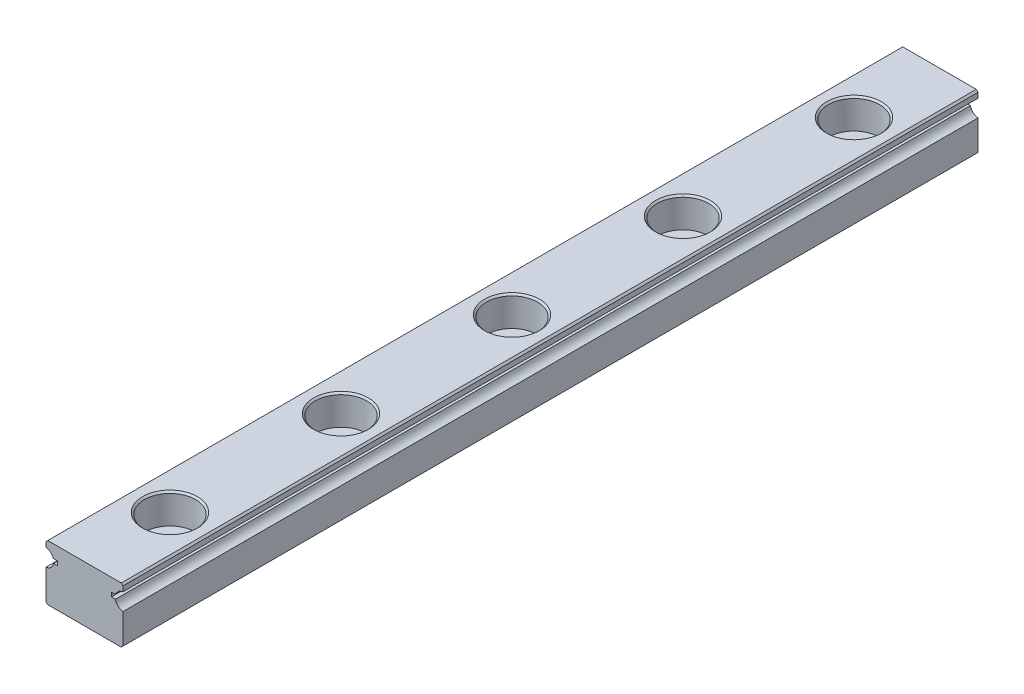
ISO-10303-21;
HEADER;
FILE_DESCRIPTION(('STEP AP214'),'2;1');
FILE_NAME('part.step','',(''),(''),'','','');
FILE_SCHEMA(('AUTOMOTIVE_DESIGN { 1 0 10303 214 1 1 1 1 }'));
ENDSEC;
DATA;
#1=APPLICATION_CONTEXT('core data for automotive mechanical design processes');
#2=APPLICATION_PROTOCOL_DEFINITION('international standard','automotive_design',2000,#1);
#3=PRODUCT_CONTEXT('',#1,'mechanical');
#4=PRODUCT('Part','Part','',(#3));
#5=PRODUCT_RELATED_PRODUCT_CATEGORY('part','',(#4));
#6=PRODUCT_DEFINITION_FORMATION('','',#4);
#7=PRODUCT_DEFINITION_CONTEXT('part definition',#1,'design');
#8=PRODUCT_DEFINITION('design','',#6,#7);
#9=PRODUCT_DEFINITION_SHAPE('','',#8);
#10=(LENGTH_UNIT() NAMED_UNIT(*) SI_UNIT(.MILLI.,.METRE.));
#11=(NAMED_UNIT(*) PLANE_ANGLE_UNIT() SI_UNIT($,.RADIAN.));
#12=(NAMED_UNIT(*) SI_UNIT($,.STERADIAN.) SOLID_ANGLE_UNIT());
#13=UNCERTAINTY_MEASURE_WITH_UNIT(LENGTH_MEASURE(1.E-05),#10,'distance_accuracy_value','');
#14=(GEOMETRIC_REPRESENTATION_CONTEXT(3) GLOBAL_UNCERTAINTY_ASSIGNED_CONTEXT((#13)) GLOBAL_UNIT_ASSIGNED_CONTEXT((#10,
#11,#12)) REPRESENTATION_CONTEXT('',''));
#15=CARTESIAN_POINT('',(0.,0.,0.));
#16=DIRECTION('',(0.,0.,1.));
#17=DIRECTION('',(1.,0.,0.));
#18=AXIS2_PLACEMENT_3D('',#15,#16,#17);
#19=CARTESIAN_POINT('',(-4.6,1.45,250.));
#20=DIRECTION('',(0.,0.,-1.));
#21=DIRECTION('',(-1.,0.,0.));
#22=AXIS2_PLACEMENT_3D('',#19,#20,#21);
#23=CYLINDRICAL_SURFACE('',#22,1.);
#24=CARTESIAN_POINT('',(-4.6,1.45,145.));
#25=DIRECTION('',(0.,0.,-1.));
#26=DIRECTION('',(-1.,0.,0.));
#27=AXIS2_PLACEMENT_3D('',#24,#25,#26);
#28=CIRCLE('',#27,1.);
#29=CARTESIAN_POINT('',(-3.65008224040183,1.7625,145.));
#30=VERTEX_POINT('',#29);
#31=CARTESIAN_POINT('',(-4.5,2.44498743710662,145.));
#32=VERTEX_POINT('',#31);
#33=EDGE_CURVE('E64',#30,#32,#28,.F.);
#34=ORIENTED_EDGE('',*,*,#33,.F.);
#35=DIRECTION('',(0.,0.,-1.));
#36=VECTOR('',#35,1.);
#37=CARTESIAN_POINT('',(-3.65008224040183,1.7625,250.));
#38=LINE('',#37,#36);
#39=CARTESIAN_POINT('',(-3.65008224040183,1.7625,245.));
#40=VERTEX_POINT('',#39);
#41=EDGE_CURVE('E251',#40,#30,#38,.T.);
#42=ORIENTED_EDGE('',*,*,#41,.F.);
#43=CARTESIAN_POINT('',(-4.6,1.45,245.));
#44=DIRECTION('',(0.,0.,1.));
#45=DIRECTION('',(1.,0.,0.));
#46=AXIS2_PLACEMENT_3D('',#43,#44,#45);
#47=CIRCLE('',#46,1.);
#48=CARTESIAN_POINT('',(-4.5,2.44498743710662,245.));
#49=VERTEX_POINT('',#48);
#50=EDGE_CURVE('E315',#49,#40,#47,.F.);
#51=ORIENTED_EDGE('',*,*,#50,.F.);
#52=DIRECTION('',(0.,0.,-1.));
#53=VECTOR('',#52,1.);
#54=CARTESIAN_POINT('',(-4.5,2.44498743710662,250.));
#55=LINE('',#54,#53);
#56=EDGE_CURVE('E324',#49,#32,#55,.T.);
#57=ORIENTED_EDGE('',*,*,#56,.T.);
#58=EDGE_LOOP('',(#34,#42,#51,#57));
#59=FACE_BOUND('',#58,.T.);
#60=ADVANCED_FACE('F42',(#59),#23,.F.);
#61=CARTESIAN_POINT('',(-3.65008224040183,1.7625,250.));
#62=DIRECTION('',(0.,1.,0.));
#63=DIRECTION('',(0.,0.,1.));
#64=AXIS2_PLACEMENT_3D('',#61,#62,#63);
#65=PLANE('',#64);
#66=DIRECTION('',(-1.,0.,0.));
#67=VECTOR('',#66,1.);
#68=CARTESIAN_POINT('',(-3.65008224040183,1.7625,145.));
#69=LINE('',#68,#67);
#70=CARTESIAN_POINT('',(-3.15008224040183,1.7625,145.));
#71=VERTEX_POINT('',#70);
#72=EDGE_CURVE('E386',#71,#30,#69,.T.);
#73=ORIENTED_EDGE('',*,*,#72,.F.);
#74=DIRECTION('',(0.,0.,-1.));
#75=VECTOR('',#74,1.);
#76=CARTESIAN_POINT('',(-3.15008224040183,1.7625,250.));
#77=LINE('',#76,#75);
#78=CARTESIAN_POINT('',(-3.15008224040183,1.7625,245.));
#79=VERTEX_POINT('',#78);
#80=EDGE_CURVE('E248',#79,#71,#77,.T.);
#81=ORIENTED_EDGE('',*,*,#80,.F.);
#82=DIRECTION('',(1.,0.,0.));
#83=VECTOR('',#82,1.);
#84=CARTESIAN_POINT('',(-3.65008224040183,1.7625,245.));
#85=LINE('',#84,#83);
#86=EDGE_CURVE('E325',#40,#79,#85,.T.);
#87=ORIENTED_EDGE('',*,*,#86,.F.);
#88=ORIENTED_EDGE('',*,*,#41,.T.);
#89=EDGE_LOOP('',(#73,#81,#87,#88));
#90=FACE_BOUND('',#89,.T.);
#91=ADVANCED_FACE('F431',(#90),#65,.F.);
#92=CARTESIAN_POINT('',(-3.15008224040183,1.2625,250.));
#93=DIRECTION('',(1.,0.,0.));
#94=DIRECTION('',(0.,0.,-1.));
#95=AXIS2_PLACEMENT_3D('',#92,#93,#94);
#96=PLANE('',#95);
#97=DIRECTION('',(0.,1.,0.));
#98=VECTOR('',#97,1.);
#99=CARTESIAN_POINT('',(-3.15008224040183,1.2625,145.));
#100=LINE('',#99,#98);
#101=CARTESIAN_POINT('',(-3.15008224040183,1.2625,145.));
#102=VERTEX_POINT('',#101);
#103=EDGE_CURVE('E384',#102,#71,#100,.T.);
#104=ORIENTED_EDGE('',*,*,#103,.F.);
#105=DIRECTION('',(0.,0.,-1.));
#106=VECTOR('',#105,1.);
#107=CARTESIAN_POINT('',(-3.15008224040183,1.2625,250.));
#108=LINE('',#107,#106);
#109=CARTESIAN_POINT('',(-3.15008224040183,1.2625,245.));
#110=VERTEX_POINT('',#109);
#111=EDGE_CURVE('E245',#110,#102,#108,.T.);
#112=ORIENTED_EDGE('',*,*,#111,.F.);
#113=DIRECTION('',(0.,-1.,0.));
#114=VECTOR('',#113,1.);
#115=CARTESIAN_POINT('',(-3.15008224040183,1.2625,245.));
#116=LINE('',#115,#114);
#117=EDGE_CURVE('E418',#79,#110,#116,.T.);
#118=ORIENTED_EDGE('',*,*,#117,.F.);
#119=ORIENTED_EDGE('',*,*,#80,.T.);
#120=EDGE_LOOP('',(#104,#112,#118,#119));
#121=FACE_BOUND('',#120,.T.);
#122=ADVANCED_FACE('F429',(#121),#96,.F.);
#123=CARTESIAN_POINT('',(-3.61773539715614,1.2625,250.));
#124=DIRECTION('',(0.,-1.,0.));
#125=DIRECTION('',(0.,0.,-1.));
#126=AXIS2_PLACEMENT_3D('',#123,#124,#125);
#127=PLANE('',#126);
#128=DIRECTION('',(1.,0.,0.));
#129=VECTOR('',#128,1.);
#130=CARTESIAN_POINT('',(-3.61773539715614,1.2625,145.));
#131=LINE('',#130,#129);
#132=CARTESIAN_POINT('',(-3.61773539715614,1.2625,145.));
#133=VERTEX_POINT('',#132);
#134=EDGE_CURVE('E382',#133,#102,#131,.T.);
#135=ORIENTED_EDGE('',*,*,#134,.F.);
#136=DIRECTION('',(0.,0.,-1.));
#137=VECTOR('',#136,1.);
#138=CARTESIAN_POINT('',(-3.61773539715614,1.2625,250.));
#139=LINE('',#138,#137);
#140=CARTESIAN_POINT('',(-3.61773539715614,1.2625,245.));
#141=VERTEX_POINT('',#140);
#142=EDGE_CURVE('E242',#141,#133,#139,.T.);
#143=ORIENTED_EDGE('',*,*,#142,.F.);
#144=DIRECTION('',(-1.,0.,0.));
#145=VECTOR('',#144,1.);
#146=CARTESIAN_POINT('',(-3.61773539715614,1.2625,245.));
#147=LINE('',#146,#145);
#148=EDGE_CURVE('E416',#110,#141,#147,.T.);
#149=ORIENTED_EDGE('',*,*,#148,.F.);
#150=ORIENTED_EDGE('',*,*,#111,.T.);
#151=EDGE_LOOP('',(#135,#143,#149,#150));
#152=FACE_BOUND('',#151,.T.);
#153=ADVANCED_FACE('F434',(#152),#127,.F.);
#154=CARTESIAN_POINT('',(-4.6,1.45,250.));
#155=DIRECTION('',(0.,0.,-1.));
#156=DIRECTION('',(-1.,0.,0.));
#157=AXIS2_PLACEMENT_3D('',#154,#155,#156);
#158=CYLINDRICAL_SURFACE('',#157,1.);
#159=CARTESIAN_POINT('',(-4.6,1.45,145.));
#160=DIRECTION('',(0.,0.,-1.));
#161=DIRECTION('',(-1.,0.,0.));
#162=AXIS2_PLACEMENT_3D('',#159,#160,#161);
#163=CIRCLE('',#162,1.);
#164=CARTESIAN_POINT('',(-4.5,0.455012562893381,145.));
#165=VERTEX_POINT('',#164);
#166=EDGE_CURVE('E380',#165,#133,#163,.F.);
#167=ORIENTED_EDGE('',*,*,#166,.F.);
#168=DIRECTION('',(0.,0.,-1.));
#169=VECTOR('',#168,1.);
#170=CARTESIAN_POINT('',(-4.5,0.455012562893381,250.));
#171=LINE('',#170,#169);
#172=CARTESIAN_POINT('',(-4.5,0.455012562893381,245.));
#173=VERTEX_POINT('',#172);
#174=EDGE_CURVE('E239',#173,#165,#171,.T.);
#175=ORIENTED_EDGE('',*,*,#174,.F.);
#176=CARTESIAN_POINT('',(-4.6,1.45,245.));
#177=DIRECTION('',(0.,0.,1.));
#178=DIRECTION('',(1.,0.,0.));
#179=AXIS2_PLACEMENT_3D('',#176,#177,#178);
#180=CIRCLE('',#179,1.);
#181=EDGE_CURVE('E414',#141,#173,#180,.F.);
#182=ORIENTED_EDGE('',*,*,#181,.F.);
#183=ORIENTED_EDGE('',*,*,#142,.T.);
#184=EDGE_LOOP('',(#167,#175,#182,#183));
#185=FACE_BOUND('',#184,.T.);
#186=ADVANCED_FACE('F441',(#185),#158,.F.);
#187=CARTESIAN_POINT('',(-4.5,-3.05,250.));
#188=DIRECTION('',(1.,0.,0.));
#189=DIRECTION('',(0.,1.,0.));
#190=AXIS2_PLACEMENT_3D('',#187,#188,#189);
#191=PLANE('',#190);
#192=DIRECTION('',(0.,1.,0.));
#193=VECTOR('',#192,1.);
#194=CARTESIAN_POINT('',(-4.5,-3.05,145.));
#195=LINE('',#194,#193);
#196=CARTESIAN_POINT('',(-4.5,-3.05,145.));
#197=VERTEX_POINT('',#196);
#198=EDGE_CURVE('E378',#197,#165,#195,.T.);
#199=ORIENTED_EDGE('',*,*,#198,.F.);
#200=DIRECTION('',(0.,0.,-1.));
#201=VECTOR('',#200,1.);
#202=CARTESIAN_POINT('',(-4.5,-3.05,250.));
#203=LINE('',#202,#201);
#204=CARTESIAN_POINT('',(-4.5,-3.05,245.));
#205=VERTEX_POINT('',#204);
#206=EDGE_CURVE('E236',#205,#197,#203,.T.);
#207=ORIENTED_EDGE('',*,*,#206,.F.);
#208=DIRECTION('',(0.,-1.,0.));
#209=VECTOR('',#208,1.);
#210=CARTESIAN_POINT('',(-4.5,-3.05,245.));
#211=LINE('',#210,#209);
#212=EDGE_CURVE('E412',#173,#205,#211,.T.);
#213=ORIENTED_EDGE('',*,*,#212,.F.);
#214=ORIENTED_EDGE('',*,*,#174,.T.);
#215=EDGE_LOOP('',(#199,#207,#213,#214));
#216=FACE_BOUND('',#215,.T.);
#217=ADVANCED_FACE('F444',(#216),#191,.F.);
#218=CARTESIAN_POINT('',(-4.5,-3.05,250.));
#219=DIRECTION('',(0.707106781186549,0.707106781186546,0.));
#220=DIRECTION('',(-0.707106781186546,0.707106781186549,0.));
#221=AXIS2_PLACEMENT_3D('',#218,#219,#220);
#222=PLANE('',#221);
#223=DIRECTION('',(-0.707106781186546,0.707106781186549,0.));
#224=VECTOR('',#223,1.);
#225=CARTESIAN_POINT('',(-4.5,-3.05,145.));
#226=LINE('',#225,#224);
#227=CARTESIAN_POINT('',(-4.3,-3.25,145.));
#228=VERTEX_POINT('',#227);
#229=EDGE_CURVE('E376',#228,#197,#226,.T.);
#230=ORIENTED_EDGE('',*,*,#229,.F.);
#231=DIRECTION('',(0.,0.,-1.));
#232=VECTOR('',#231,1.);
#233=CARTESIAN_POINT('',(-4.3,-3.25,250.));
#234=LINE('',#233,#232);
#235=CARTESIAN_POINT('',(-4.3,-3.25,245.));
#236=VERTEX_POINT('',#235);
#237=EDGE_CURVE('E233',#236,#228,#234,.T.);
#238=ORIENTED_EDGE('',*,*,#237,.F.);
#239=DIRECTION('',(0.707106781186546,-0.707106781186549,0.));
#240=VECTOR('',#239,1.);
#241=CARTESIAN_POINT('',(-4.5,-3.05,245.));
#242=LINE('',#241,#240);
#243=EDGE_CURVE('E410',#205,#236,#242,.T.);
#244=ORIENTED_EDGE('',*,*,#243,.F.);
#245=ORIENTED_EDGE('',*,*,#206,.T.);
#246=EDGE_LOOP('',(#230,#238,#244,#245));
#247=FACE_BOUND('',#246,.T.);
#248=ADVANCED_FACE('F451',(#247),#222,.F.);
#249=CARTESIAN_POINT('',(-4.3,-3.25,250.));
#250=DIRECTION('',(0.,1.,0.));
#251=DIRECTION('',(0.,0.,1.));
#252=AXIS2_PLACEMENT_3D('',#249,#250,#251);
#253=PLANE('',#252);
#254=CARTESIAN_POINT('',(0.,-3.25,235.));
#255=DIRECTION('',(0.,1.,0.));
#256=DIRECTION('',(0.,0.,1.));
#257=AXIS2_PLACEMENT_3D('',#254,#255,#256);
#258=CIRCLE('',#257,1.9500000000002);
#259=CARTESIAN_POINT('',(0.,-3.25,236.95));
#260=VERTEX_POINT('',#259);
#261=EDGE_CURVE('E305',#260,#260,#258,.T.);
#262=ORIENTED_EDGE('',*,*,#261,.T.);
#263=EDGE_LOOP('',(#262));
#264=FACE_BOUND('',#263,.T.);
#265=CARTESIAN_POINT('',(0.,-3.25,215.));
#266=DIRECTION('',(0.,1.,0.));
#267=DIRECTION('',(0.,0.,1.));
#268=AXIS2_PLACEMENT_3D('',#265,#266,#267);
#269=CIRCLE('',#268,1.9500000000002);
#270=CARTESIAN_POINT('',(0.,-3.25,216.95));
#271=VERTEX_POINT('',#270);
#272=EDGE_CURVE('E293',#271,#271,#269,.T.);
#273=ORIENTED_EDGE('',*,*,#272,.T.);
#274=EDGE_LOOP('',(#273));
#275=FACE_BOUND('',#274,.T.);
#276=CARTESIAN_POINT('',(0.,-3.25,195.));
#277=DIRECTION('',(0.,1.,0.));
#278=DIRECTION('',(0.,0.,1.));
#279=AXIS2_PLACEMENT_3D('',#276,#277,#278);
#280=CIRCLE('',#279,1.9500000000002);
#281=CARTESIAN_POINT('',(0.,-3.25,196.95));
#282=VERTEX_POINT('',#281);
#283=EDGE_CURVE('E281',#282,#282,#280,.T.);
#284=ORIENTED_EDGE('',*,*,#283,.T.);
#285=EDGE_LOOP('',(#284));
#286=FACE_BOUND('',#285,.T.);
#287=CARTESIAN_POINT('',(0.,-3.25,175.));
#288=DIRECTION('',(0.,1.,0.));
#289=DIRECTION('',(0.,0.,1.));
#290=AXIS2_PLACEMENT_3D('',#287,#288,#289);
#291=CIRCLE('',#290,1.9500000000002);
#292=CARTESIAN_POINT('',(0.,-3.25,176.95));
#293=VERTEX_POINT('',#292);
#294=EDGE_CURVE('E269',#293,#293,#291,.T.);
#295=ORIENTED_EDGE('',*,*,#294,.T.);
#296=EDGE_LOOP('',(#295));
#297=FACE_BOUND('',#296,.T.);
#298=CARTESIAN_POINT('',(0.,-3.25,155.));
#299=DIRECTION('',(0.,1.,0.));
#300=DIRECTION('',(0.,0.,1.));
#301=AXIS2_PLACEMENT_3D('',#298,#299,#300);
#302=CIRCLE('',#301,1.9500000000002);
#303=CARTESIAN_POINT('',(0.,-3.25,156.95));
#304=VERTEX_POINT('',#303);
#305=EDGE_CURVE('E257',#304,#304,#302,.T.);
#306=ORIENTED_EDGE('',*,*,#305,.T.);
#307=EDGE_LOOP('',(#306));
#308=FACE_BOUND('',#307,.T.);
#309=DIRECTION('',(-1.,0.,0.));
#310=VECTOR('',#309,1.);
#311=CARTESIAN_POINT('',(-4.3,-3.25,145.));
#312=LINE('',#311,#310);
#313=CARTESIAN_POINT('',(4.3,-3.25,145.));
#314=VERTEX_POINT('',#313);
#315=EDGE_CURVE('E374',#314,#228,#312,.T.);
#316=ORIENTED_EDGE('',*,*,#315,.F.);
#317=DIRECTION('',(0.,0.,-1.));
#318=VECTOR('',#317,1.);
#319=CARTESIAN_POINT('',(4.3,-3.25,250.));
#320=LINE('',#319,#318);
#321=CARTESIAN_POINT('',(4.3,-3.25,245.));
#322=VERTEX_POINT('',#321);
#323=EDGE_CURVE('E230',#322,#314,#320,.T.);
#324=ORIENTED_EDGE('',*,*,#323,.F.);
#325=DIRECTION('',(1.,0.,0.));
#326=VECTOR('',#325,1.);
#327=CARTESIAN_POINT('',(-4.3,-3.25,245.));
#328=LINE('',#327,#326);
#329=EDGE_CURVE('E408',#236,#322,#328,.T.);
#330=ORIENTED_EDGE('',*,*,#329,.F.);
#331=ORIENTED_EDGE('',*,*,#237,.T.);
#332=EDGE_LOOP('',(#316,#324,#330,#331));
#333=FACE_BOUND('',#332,.T.);
#334=ADVANCED_FACE('F454',(#264,#275,#286,#297,#308,#333),#253,.F.);
#335=CARTESIAN_POINT('',(4.3,-3.25,250.));
#336=DIRECTION('',(-0.707106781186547,0.707106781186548,0.));
#337=DIRECTION('',(-0.707106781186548,-0.707106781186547,0.));
#338=AXIS2_PLACEMENT_3D('',#335,#336,#337);
#339=PLANE('',#338);
#340=DIRECTION('',(-0.707106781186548,-0.707106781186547,0.));
#341=VECTOR('',#340,1.);
#342=CARTESIAN_POINT('',(4.3,-3.25,145.));
#343=LINE('',#342,#341);
#344=CARTESIAN_POINT('',(4.5,-3.05,145.));
#345=VERTEX_POINT('',#344);
#346=EDGE_CURVE('E372',#345,#314,#343,.T.);
#347=ORIENTED_EDGE('',*,*,#346,.F.);
#348=DIRECTION('',(0.,0.,-1.));
#349=VECTOR('',#348,1.);
#350=CARTESIAN_POINT('',(4.5,-3.05,250.));
#351=LINE('',#350,#349);
#352=CARTESIAN_POINT('',(4.5,-3.05,245.));
#353=VERTEX_POINT('',#352);
#354=EDGE_CURVE('E227',#353,#345,#351,.T.);
#355=ORIENTED_EDGE('',*,*,#354,.F.);
#356=DIRECTION('',(0.707106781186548,0.707106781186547,0.));
#357=VECTOR('',#356,1.);
#358=CARTESIAN_POINT('',(4.3,-3.25,245.));
#359=LINE('',#358,#357);
#360=EDGE_CURVE('E406',#322,#353,#359,.T.);
#361=ORIENTED_EDGE('',*,*,#360,.F.);
#362=ORIENTED_EDGE('',*,*,#323,.T.);
#363=EDGE_LOOP('',(#347,#355,#361,#362));
#364=FACE_BOUND('',#363,.T.);
#365=ADVANCED_FACE('F461',(#364),#339,.F.);
#366=CARTESIAN_POINT('',(4.5,-3.05,250.));
#367=DIRECTION('',(-1.,0.,0.));
#368=DIRECTION('',(0.,-1.,0.));
#369=AXIS2_PLACEMENT_3D('',#366,#367,#368);
#370=PLANE('',#369);
#371=DIRECTION('',(0.,-1.,0.));
#372=VECTOR('',#371,1.);
#373=CARTESIAN_POINT('',(4.5,-3.05,145.));
#374=LINE('',#373,#372);
#375=CARTESIAN_POINT('',(4.5,0.455012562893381,145.));
#376=VERTEX_POINT('',#375);
#377=EDGE_CURVE('E370',#376,#345,#374,.T.);
#378=ORIENTED_EDGE('',*,*,#377,.F.);
#379=DIRECTION('',(0.,0.,-1.));
#380=VECTOR('',#379,1.);
#381=CARTESIAN_POINT('',(4.5,0.455012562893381,250.));
#382=LINE('',#381,#380);
#383=CARTESIAN_POINT('',(4.5,0.455012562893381,245.));
#384=VERTEX_POINT('',#383);
#385=EDGE_CURVE('E224',#384,#376,#382,.T.);
#386=ORIENTED_EDGE('',*,*,#385,.F.);
#387=DIRECTION('',(0.,1.,0.));
#388=VECTOR('',#387,1.);
#389=CARTESIAN_POINT('',(4.5,-3.05,245.));
#390=LINE('',#389,#388);
#391=EDGE_CURVE('E404',#353,#384,#390,.T.);
#392=ORIENTED_EDGE('',*,*,#391,.F.);
#393=ORIENTED_EDGE('',*,*,#354,.T.);
#394=EDGE_LOOP('',(#378,#386,#392,#393));
#395=FACE_BOUND('',#394,.T.);
#396=ADVANCED_FACE('F464',(#395),#370,.F.);
#397=CARTESIAN_POINT('',(4.6,1.45,250.));
#398=DIRECTION('',(0.,0.,-1.));
#399=DIRECTION('',(-1.,0.,0.));
#400=AXIS2_PLACEMENT_3D('',#397,#398,#399);
#401=CYLINDRICAL_SURFACE('',#400,1.);
#402=CARTESIAN_POINT('',(4.6,1.45,145.));
#403=DIRECTION('',(0.,0.,-1.));
#404=DIRECTION('',(-1.,0.,0.));
#405=AXIS2_PLACEMENT_3D('',#402,#403,#404);
#406=CIRCLE('',#405,1.);
#407=CARTESIAN_POINT('',(3.61773539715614,1.2625,145.));
#408=VERTEX_POINT('',#407);
#409=EDGE_CURVE('E368',#408,#376,#406,.F.);
#410=ORIENTED_EDGE('',*,*,#409,.F.);
#411=DIRECTION('',(0.,0.,-1.));
#412=VECTOR('',#411,1.);
#413=CARTESIAN_POINT('',(3.61773539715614,1.2625,250.));
#414=LINE('',#413,#412);
#415=CARTESIAN_POINT('',(3.61773539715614,1.2625,245.));
#416=VERTEX_POINT('',#415);
#417=EDGE_CURVE('E221',#416,#408,#414,.T.);
#418=ORIENTED_EDGE('',*,*,#417,.F.);
#419=CARTESIAN_POINT('',(4.6,1.45,245.));
#420=DIRECTION('',(0.,0.,1.));
#421=DIRECTION('',(1.,0.,0.));
#422=AXIS2_PLACEMENT_3D('',#419,#420,#421);
#423=CIRCLE('',#422,1.);
#424=EDGE_CURVE('E402',#384,#416,#423,.F.);
#425=ORIENTED_EDGE('',*,*,#424,.F.);
#426=ORIENTED_EDGE('',*,*,#385,.T.);
#427=EDGE_LOOP('',(#410,#418,#425,#426));
#428=FACE_BOUND('',#427,.T.);
#429=ADVANCED_FACE('F471',(#428),#401,.F.);
#430=CARTESIAN_POINT('',(3.61773539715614,1.2625,250.));
#431=DIRECTION('',(0.,-1.,0.));
#432=DIRECTION('',(0.,0.,-1.));
#433=AXIS2_PLACEMENT_3D('',#430,#431,#432);
#434=PLANE('',#433);
#435=DIRECTION('',(1.,0.,0.));
#436=VECTOR('',#435,1.);
#437=CARTESIAN_POINT('',(3.61773539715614,1.2625,145.));
#438=LINE('',#437,#436);
#439=CARTESIAN_POINT('',(3.15008224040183,1.2625,145.));
#440=VERTEX_POINT('',#439);
#441=EDGE_CURVE('E366',#440,#408,#438,.T.);
#442=ORIENTED_EDGE('',*,*,#441,.F.);
#443=DIRECTION('',(0.,0.,-1.));
#444=VECTOR('',#443,1.);
#445=CARTESIAN_POINT('',(3.15008224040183,1.2625,250.));
#446=LINE('',#445,#444);
#447=CARTESIAN_POINT('',(3.15008224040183,1.2625,245.));
#448=VERTEX_POINT('',#447);
#449=EDGE_CURVE('E218',#448,#440,#446,.T.);
#450=ORIENTED_EDGE('',*,*,#449,.F.);
#451=DIRECTION('',(-1.,0.,0.));
#452=VECTOR('',#451,1.);
#453=CARTESIAN_POINT('',(3.61773539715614,1.2625,245.));
#454=LINE('',#453,#452);
#455=EDGE_CURVE('E400',#416,#448,#454,.T.);
#456=ORIENTED_EDGE('',*,*,#455,.F.);
#457=ORIENTED_EDGE('',*,*,#417,.T.);
#458=EDGE_LOOP('',(#442,#450,#456,#457));
#459=FACE_BOUND('',#458,.T.);
#460=ADVANCED_FACE('F474',(#459),#434,.F.);
#461=CARTESIAN_POINT('',(3.15008224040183,1.2625,250.));
#462=DIRECTION('',(-1.,0.,0.));
#463=DIRECTION('',(0.,0.,1.));
#464=AXIS2_PLACEMENT_3D('',#461,#462,#463);
#465=PLANE('',#464);
#466=DIRECTION('',(0.,-1.,0.));
#467=VECTOR('',#466,1.);
#468=CARTESIAN_POINT('',(3.15008224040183,1.2625,145.));
#469=LINE('',#468,#467);
#470=CARTESIAN_POINT('',(3.15008224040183,1.7625,145.));
#471=VERTEX_POINT('',#470);
#472=EDGE_CURVE('E364',#471,#440,#469,.T.);
#473=ORIENTED_EDGE('',*,*,#472,.F.);
#474=DIRECTION('',(0.,0.,-1.));
#475=VECTOR('',#474,1.);
#476=CARTESIAN_POINT('',(3.15008224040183,1.7625,250.));
#477=LINE('',#476,#475);
#478=CARTESIAN_POINT('',(3.15008224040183,1.7625,245.));
#479=VERTEX_POINT('',#478);
#480=EDGE_CURVE('E215',#479,#471,#477,.T.);
#481=ORIENTED_EDGE('',*,*,#480,.F.);
#482=DIRECTION('',(0.,1.,0.));
#483=VECTOR('',#482,1.);
#484=CARTESIAN_POINT('',(3.15008224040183,1.2625,245.));
#485=LINE('',#484,#483);
#486=EDGE_CURVE('E398',#448,#479,#485,.T.);
#487=ORIENTED_EDGE('',*,*,#486,.F.);
#488=ORIENTED_EDGE('',*,*,#449,.T.);
#489=EDGE_LOOP('',(#473,#481,#487,#488));
#490=FACE_BOUND('',#489,.T.);
#491=ADVANCED_FACE('F481',(#490),#465,.F.);
#492=CARTESIAN_POINT('',(3.65008224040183,1.7625,250.));
#493=DIRECTION('',(0.,1.,0.));
#494=DIRECTION('',(0.,0.,1.));
#495=AXIS2_PLACEMENT_3D('',#492,#493,#494);
#496=PLANE('',#495);
#497=DIRECTION('',(-1.,0.,0.));
#498=VECTOR('',#497,1.);
#499=CARTESIAN_POINT('',(3.65008224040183,1.7625,145.));
#500=LINE('',#499,#498);
#501=CARTESIAN_POINT('',(3.65008224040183,1.7625,145.));
#502=VERTEX_POINT('',#501);
#503=EDGE_CURVE('E362',#502,#471,#500,.T.);
#504=ORIENTED_EDGE('',*,*,#503,.F.);
#505=DIRECTION('',(0.,0.,-1.));
#506=VECTOR('',#505,1.);
#507=CARTESIAN_POINT('',(3.65008224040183,1.7625,250.));
#508=LINE('',#507,#506);
#509=CARTESIAN_POINT('',(3.65008224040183,1.7625,245.));
#510=VERTEX_POINT('',#509);
#511=EDGE_CURVE('E212',#510,#502,#508,.T.);
#512=ORIENTED_EDGE('',*,*,#511,.F.);
#513=DIRECTION('',(1.,0.,0.));
#514=VECTOR('',#513,1.);
#515=CARTESIAN_POINT('',(3.65008224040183,1.7625,245.));
#516=LINE('',#515,#514);
#517=EDGE_CURVE('E396',#479,#510,#516,.T.);
#518=ORIENTED_EDGE('',*,*,#517,.F.);
#519=ORIENTED_EDGE('',*,*,#480,.T.);
#520=EDGE_LOOP('',(#504,#512,#518,#519));
#521=FACE_BOUND('',#520,.T.);
#522=ADVANCED_FACE('F484',(#521),#496,.F.);
#523=CARTESIAN_POINT('',(4.6,1.45,250.));
#524=DIRECTION('',(0.,0.,-1.));
#525=DIRECTION('',(-1.,0.,0.));
#526=AXIS2_PLACEMENT_3D('',#523,#524,#525);
#527=CYLINDRICAL_SURFACE('',#526,1.);
#528=CARTESIAN_POINT('',(4.6,1.45,145.));
#529=DIRECTION('',(0.,0.,-1.));
#530=DIRECTION('',(-1.,0.,0.));
#531=AXIS2_PLACEMENT_3D('',#528,#529,#530);
#532=CIRCLE('',#531,1.);
#533=CARTESIAN_POINT('',(4.5,2.44498743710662,145.));
#534=VERTEX_POINT('',#533);
#535=EDGE_CURVE('E360',#534,#502,#532,.F.);
#536=ORIENTED_EDGE('',*,*,#535,.F.);
#537=DIRECTION('',(0.,0.,-1.));
#538=VECTOR('',#537,1.);
#539=CARTESIAN_POINT('',(4.5,2.44498743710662,250.));
#540=LINE('',#539,#538);
#541=CARTESIAN_POINT('',(4.5,2.44498743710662,245.));
#542=VERTEX_POINT('',#541);
#543=EDGE_CURVE('E204',#542,#534,#540,.T.);
#544=ORIENTED_EDGE('',*,*,#543,.F.);
#545=CARTESIAN_POINT('',(4.6,1.45,245.));
#546=DIRECTION('',(0.,0.,1.));
#547=DIRECTION('',(1.,0.,0.));
#548=AXIS2_PLACEMENT_3D('',#545,#546,#547);
#549=CIRCLE('',#548,1.);
#550=EDGE_CURVE('E394',#510,#542,#549,.F.);
#551=ORIENTED_EDGE('',*,*,#550,.F.);
#552=ORIENTED_EDGE('',*,*,#511,.T.);
#553=EDGE_LOOP('',(#536,#544,#551,#552));
#554=FACE_BOUND('',#553,.T.);
#555=ADVANCED_FACE('F491',(#554),#527,.F.);
#556=CARTESIAN_POINT('',(4.5,2.44498743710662,250.));
#557=DIRECTION('',(-1.,0.,0.));
#558=DIRECTION('',(0.,-1.,0.));
#559=AXIS2_PLACEMENT_3D('',#556,#557,#558);
#560=PLANE('',#559);
#561=DIRECTION('',(0.,-1.,0.));
#562=VECTOR('',#561,1.);
#563=CARTESIAN_POINT('',(4.5,2.44498743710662,145.));
#564=LINE('',#563,#562);
#565=CARTESIAN_POINT('',(4.5,3.05,145.));
#566=VERTEX_POINT('',#565);
#567=EDGE_CURVE('E198',#566,#534,#564,.T.);
#568=ORIENTED_EDGE('',*,*,#567,.F.);
#569=DIRECTION('',(0.,0.,-1.));
#570=VECTOR('',#569,1.);
#571=CARTESIAN_POINT('',(4.5,3.05,250.));
#572=LINE('',#571,#570);
#573=CARTESIAN_POINT('',(4.5,3.05,245.));
#574=VERTEX_POINT('',#573);
#575=EDGE_CURVE('E196',#574,#566,#572,.T.);
#576=ORIENTED_EDGE('',*,*,#575,.F.);
#577=DIRECTION('',(0.,1.,0.));
#578=VECTOR('',#577,1.);
#579=CARTESIAN_POINT('',(4.5,2.44498743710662,245.));
#580=LINE('',#579,#578);
#581=EDGE_CURVE('E392',#542,#574,#580,.T.);
#582=ORIENTED_EDGE('',*,*,#581,.F.);
#583=ORIENTED_EDGE('',*,*,#543,.T.);
#584=EDGE_LOOP('',(#568,#576,#582,#583));
#585=FACE_BOUND('',#584,.T.);
#586=ADVANCED_FACE('F493',(#585),#560,.F.);
#587=CARTESIAN_POINT('',(4.3,3.25,250.));
#588=DIRECTION('',(-0.707106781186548,-0.707106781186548,0.));
#589=DIRECTION('',(0.707106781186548,-0.707106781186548,0.));
#590=AXIS2_PLACEMENT_3D('',#587,#588,#589);
#591=PLANE('',#590);
#592=DIRECTION('',(0.707106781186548,-0.707106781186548,0.));
#593=VECTOR('',#592,1.);
#594=CARTESIAN_POINT('',(4.3,3.25,145.));
#595=LINE('',#594,#593);
#596=CARTESIAN_POINT('',(4.29999999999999,3.25,145.));
#597=VERTEX_POINT('',#596);
#598=EDGE_CURVE('E179',#597,#566,#595,.T.);
#599=ORIENTED_EDGE('',*,*,#598,.F.);
#600=DIRECTION('',(0.,0.,-1.));
#601=VECTOR('',#600,1.);
#602=CARTESIAN_POINT('',(4.3,3.25,250.));
#603=LINE('',#602,#601);
#604=CARTESIAN_POINT('',(4.3,3.25,245.));
#605=VERTEX_POINT('',#604);
#606=EDGE_CURVE('E194',#605,#597,#603,.T.);
#607=ORIENTED_EDGE('',*,*,#606,.F.);
#608=DIRECTION('',(-0.707106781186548,0.707106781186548,0.));
#609=VECTOR('',#608,1.);
#610=CARTESIAN_POINT('',(4.3,3.25,245.));
#611=LINE('',#610,#609);
#612=EDGE_CURVE('E390',#574,#605,#611,.T.);
#613=ORIENTED_EDGE('',*,*,#612,.F.);
#614=ORIENTED_EDGE('',*,*,#575,.T.);
#615=EDGE_LOOP('',(#599,#607,#613,#614));
#616=FACE_BOUND('',#615,.T.);
#617=ADVANCED_FACE('F192',(#616),#591,.F.);
#618=CARTESIAN_POINT('',(-4.3,3.25,250.));
#619=DIRECTION('',(0.,-1.,0.));
#620=DIRECTION('',(0.,0.,-1.));
#621=AXIS2_PLACEMENT_3D('',#618,#619,#620);
#622=PLANE('',#621);
#623=CARTESIAN_POINT('',(0.,3.25,235.));
#624=DIRECTION('',(0.,-1.,0.));
#625=DIRECTION('',(0.,0.,-1.));
#626=AXIS2_PLACEMENT_3D('',#623,#624,#625);
#627=CIRCLE('',#626,3.19999999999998);
#628=CARTESIAN_POINT('',(0.,3.25,231.8));
#629=VERTEX_POINT('',#628);
#630=EDGE_CURVE('E311',#629,#629,#627,.T.);
#631=ORIENTED_EDGE('',*,*,#630,.T.);
#632=EDGE_LOOP('',(#631));
#633=FACE_BOUND('',#632,.T.);
#634=CARTESIAN_POINT('',(0.,3.25,215.));
#635=DIRECTION('',(0.,-1.,0.));
#636=DIRECTION('',(0.,0.,-1.));
#637=AXIS2_PLACEMENT_3D('',#634,#635,#636);
#638=CIRCLE('',#637,3.19999999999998);
#639=CARTESIAN_POINT('',(0.,3.25,211.8));
#640=VERTEX_POINT('',#639);
#641=EDGE_CURVE('E299',#640,#640,#638,.T.);
#642=ORIENTED_EDGE('',*,*,#641,.T.);
#643=EDGE_LOOP('',(#642));
#644=FACE_BOUND('',#643,.T.);
#645=CARTESIAN_POINT('',(0.,3.25,195.));
#646=DIRECTION('',(0.,-1.,0.));
#647=DIRECTION('',(0.,0.,-1.));
#648=AXIS2_PLACEMENT_3D('',#645,#646,#647);
#649=CIRCLE('',#648,3.19999999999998);
#650=CARTESIAN_POINT('',(0.,3.25,191.8));
#651=VERTEX_POINT('',#650);
#652=EDGE_CURVE('E287',#651,#651,#649,.T.);
#653=ORIENTED_EDGE('',*,*,#652,.T.);
#654=EDGE_LOOP('',(#653));
#655=FACE_BOUND('',#654,.T.);
#656=CARTESIAN_POINT('',(0.,3.25,175.));
#657=DIRECTION('',(0.,-1.,0.));
#658=DIRECTION('',(0.,0.,-1.));
#659=AXIS2_PLACEMENT_3D('',#656,#657,#658);
#660=CIRCLE('',#659,3.19999999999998);
#661=CARTESIAN_POINT('',(0.,3.25,171.8));
#662=VERTEX_POINT('',#661);
#663=EDGE_CURVE('E275',#662,#662,#660,.T.);
#664=ORIENTED_EDGE('',*,*,#663,.T.);
#665=EDGE_LOOP('',(#664));
#666=FACE_BOUND('',#665,.T.);
#667=CARTESIAN_POINT('',(0.,3.25,155.));
#668=DIRECTION('',(0.,-1.,0.));
#669=DIRECTION('',(0.,0.,-1.));
#670=AXIS2_PLACEMENT_3D('',#667,#668,#669);
#671=CIRCLE('',#670,3.19999999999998);
#672=CARTESIAN_POINT('',(0.,3.25,151.8));
#673=VERTEX_POINT('',#672);
#674=EDGE_CURVE('E263',#673,#673,#671,.T.);
#675=ORIENTED_EDGE('',*,*,#674,.T.);
#676=EDGE_LOOP('',(#675));
#677=FACE_BOUND('',#676,.T.);
#678=DIRECTION('',(-1.,0.,0.));
#679=VECTOR('',#678,1.);
#680=CARTESIAN_POINT('',(-15.,3.25,145.));
#681=LINE('',#680,#679);
#682=CARTESIAN_POINT('',(-4.3,3.25,145.));
#683=VERTEX_POINT('',#682);
#684=EDGE_CURVE('E176',#597,#683,#681,.T.);
#685=ORIENTED_EDGE('',*,*,#684,.T.);
#686=DIRECTION('',(0.,0.,-1.));
#687=VECTOR('',#686,1.);
#688=CARTESIAN_POINT('',(-4.3,3.25,250.));
#689=LINE('',#688,#687);
#690=CARTESIAN_POINT('',(-4.3,3.25,245.));
#691=VERTEX_POINT('',#690);
#692=EDGE_CURVE('E202',#691,#683,#689,.T.);
#693=ORIENTED_EDGE('',*,*,#692,.F.);
#694=DIRECTION('',(1.,0.,0.));
#695=VECTOR('',#694,1.);
#696=CARTESIAN_POINT('',(-15.,3.25,245.));
#697=LINE('',#696,#695);
#698=EDGE_CURVE('E187',#691,#605,#697,.T.);
#699=ORIENTED_EDGE('',*,*,#698,.T.);
#700=ORIENTED_EDGE('',*,*,#606,.T.);
#701=EDGE_LOOP('',(#685,#693,#699,#700));
#702=FACE_BOUND('',#701,.T.);
#703=ADVANCED_FACE('F201',(#633,#644,#655,#666,#677,#702),#622,.F.);
#704=CARTESIAN_POINT('',(-4.5,3.05,250.));
#705=DIRECTION('',(0.707106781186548,-0.707106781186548,0.));
#706=DIRECTION('',(0.707106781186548,0.707106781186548,0.));
#707=AXIS2_PLACEMENT_3D('',#704,#705,#706);
#708=PLANE('',#707);
#709=DIRECTION('',(0.707106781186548,0.707106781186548,0.));
#710=VECTOR('',#709,1.);
#711=CARTESIAN_POINT('',(-4.5,3.05,145.));
#712=LINE('',#711,#710);
#713=CARTESIAN_POINT('',(-4.5,3.05,145.));
#714=VERTEX_POINT('',#713);
#715=EDGE_CURVE('E182',#714,#683,#712,.T.);
#716=ORIENTED_EDGE('',*,*,#715,.F.);
#717=DIRECTION('',(0.,0.,-1.));
#718=VECTOR('',#717,1.);
#719=CARTESIAN_POINT('',(-4.5,3.05,250.));
#720=LINE('',#719,#718);
#721=CARTESIAN_POINT('',(-4.5,3.05,245.));
#722=VERTEX_POINT('',#721);
#723=EDGE_CURVE('E206',#722,#714,#720,.T.);
#724=ORIENTED_EDGE('',*,*,#723,.F.);
#725=DIRECTION('',(-0.707106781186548,-0.707106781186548,0.));
#726=VECTOR('',#725,1.);
#727=CARTESIAN_POINT('',(-4.5,3.05,245.));
#728=LINE('',#727,#726);
#729=EDGE_CURVE('E57',#691,#722,#728,.T.);
#730=ORIENTED_EDGE('',*,*,#729,.F.);
#731=ORIENTED_EDGE('',*,*,#692,.T.);
#732=EDGE_LOOP('',(#716,#724,#730,#731));
#733=FACE_BOUND('',#732,.T.);
#734=ADVANCED_FACE('F495',(#733),#708,.F.);
#735=CARTESIAN_POINT('',(-4.5,2.44498743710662,250.));
#736=DIRECTION('',(1.,0.,0.));
#737=DIRECTION('',(0.,1.,0.));
#738=AXIS2_PLACEMENT_3D('',#735,#736,#737);
#739=PLANE('',#738);
#740=DIRECTION('',(0.,1.,0.));
#741=VECTOR('',#740,1.);
#742=CARTESIAN_POINT('',(-4.5,2.44498743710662,145.));
#743=LINE('',#742,#741);
#744=EDGE_CURVE('E12',#32,#714,#743,.T.);
#745=ORIENTED_EDGE('',*,*,#744,.F.);
#746=ORIENTED_EDGE('',*,*,#56,.F.);
#747=DIRECTION('',(0.,-1.,0.));
#748=VECTOR('',#747,1.);
#749=CARTESIAN_POINT('',(-4.5,2.44498743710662,245.));
#750=LINE('',#749,#748);
#751=EDGE_CURVE('E50',#722,#49,#750,.T.);
#752=ORIENTED_EDGE('',*,*,#751,.F.);
#753=ORIENTED_EDGE('',*,*,#723,.T.);
#754=EDGE_LOOP('',(#745,#746,#752,#753));
#755=FACE_BOUND('',#754,.T.);
#756=ADVANCED_FACE('F327',(#755),#739,.F.);
#757=CARTESIAN_POINT('',(0.,-3.251,235.));
#758=DIRECTION('',(0.,1.,0.));
#759=DIRECTION('',(0.,0.,1.));
#760=AXIS2_PLACEMENT_3D('',#757,#758,#759);
#761=CYLINDRICAL_SURFACE('',#760,1.75);
#762=CARTESIAN_POINT('',(0.,-3.04999999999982,235.));
#763=DIRECTION('',(0.,1.,0.));
#764=DIRECTION('',(0.,0.,1.));
#765=AXIS2_PLACEMENT_3D('',#762,#763,#764);
#766=CIRCLE('',#765,1.75);
#767=CARTESIAN_POINT('',(0.,-3.04999999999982,236.75));
#768=VERTEX_POINT('',#767);
#769=EDGE_CURVE('E302',#768,#768,#766,.F.);
#770=CARTESIAN_POINT('',(0.,-0.249999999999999,235.));
#771=DIRECTION('',(0.,1.,0.));
#772=DIRECTION('',(0.,0.,1.));
#773=AXIS2_PLACEMENT_3D('',#770,#771,#772);
#774=CIRCLE('',#773,1.75);
#775=CARTESIAN_POINT('',(0.,-0.249999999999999,236.75));
#776=VERTEX_POINT('',#775);
#777=EDGE_CURVE('E197',#776,#776,#774,.T.);
#778=CARTESIAN_POINT('',(0.,-3.04999999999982,236.75));
#779=CARTESIAN_POINT('',(0.,-3.02083333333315,236.75));
#780=CARTESIAN_POINT('',(0.,-2.99166666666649,236.75));
#781=CARTESIAN_POINT('',(0.,-2.93333333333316,236.75));
#782=CARTESIAN_POINT('',(0.,-2.90416666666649,236.75));
#783=CARTESIAN_POINT('',(0.,-2.84583333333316,236.75));
#784=CARTESIAN_POINT('',(0.,-2.8166666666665,236.75));
#785=CARTESIAN_POINT('',(0.,-2.75833333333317,236.75));
#786=CARTESIAN_POINT('',(0.,-2.7291666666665,236.75));
#787=CARTESIAN_POINT('',(0.,-2.67083333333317,236.75));
#788=CARTESIAN_POINT('',(0.,-2.64166666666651,236.75));
#789=CARTESIAN_POINT('',(0.,-2.58333333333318,236.75));
#790=CARTESIAN_POINT('',(0.,-2.55416666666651,236.75));
#791=CARTESIAN_POINT('',(0.,-2.49583333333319,236.75));
#792=CARTESIAN_POINT('',(0.,-2.46666666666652,236.75));
#793=CARTESIAN_POINT('',(0.,-2.40833333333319,236.75));
#794=CARTESIAN_POINT('',(0.,-2.37916666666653,236.75));
#795=CARTESIAN_POINT('',(0.,-2.3208333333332,236.75));
#796=CARTESIAN_POINT('',(0.,-2.29166666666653,236.75));
#797=CARTESIAN_POINT('',(0.,-2.2333333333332,236.75));
#798=CARTESIAN_POINT('',(0.,-2.20416666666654,236.75));
#799=CARTESIAN_POINT('',(0.,-2.14583333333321,236.75));
#800=CARTESIAN_POINT('',(0.,-2.11666666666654,236.75));
#801=CARTESIAN_POINT('',(0.,-2.05833333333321,236.75));
#802=CARTESIAN_POINT('',(0.,-2.02916666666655,236.75));
#803=CARTESIAN_POINT('',(0.,-1.97083333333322,236.75));
#804=CARTESIAN_POINT('',(0.,-1.94166666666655,236.75));
#805=CARTESIAN_POINT('',(0.,-1.88333333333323,236.75));
#806=CARTESIAN_POINT('',(0.,-1.85416666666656,236.75));
#807=CARTESIAN_POINT('',(0.,-1.79583333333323,236.75));
#808=CARTESIAN_POINT('',(0.,-1.76666666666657,236.75));
#809=CARTESIAN_POINT('',(0.,-1.70833333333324,236.75));
#810=CARTESIAN_POINT('',(0.,-1.67916666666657,236.75));
#811=CARTESIAN_POINT('',(0.,-1.62083333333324,236.75));
#812=CARTESIAN_POINT('',(0.,-1.59166666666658,236.75));
#813=CARTESIAN_POINT('',(0.,-1.53333333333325,236.75));
#814=CARTESIAN_POINT('',(0.,-1.50416666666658,236.75));
#815=CARTESIAN_POINT('',(0.,-1.44583333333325,236.75));
#816=CARTESIAN_POINT('',(0.,-1.41666666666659,236.75));
#817=CARTESIAN_POINT('',(0.,-1.35833333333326,236.75));
#818=CARTESIAN_POINT('',(0.,-1.32916666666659,236.75));
#819=CARTESIAN_POINT('',(0.,-1.27083333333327,236.75));
#820=CARTESIAN_POINT('',(0.,-1.2416666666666,236.75));
#821=CARTESIAN_POINT('',(0.,-1.18333333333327,236.75));
#822=CARTESIAN_POINT('',(0.,-1.15416666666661,236.75));
#823=CARTESIAN_POINT('',(0.,-1.09583333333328,236.75));
#824=CARTESIAN_POINT('',(0.,-1.06666666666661,236.75));
#825=CARTESIAN_POINT('',(0.,-1.00833333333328,236.75));
#826=CARTESIAN_POINT('',(0.,-0.979166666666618,236.75));
#827=CARTESIAN_POINT('',(0.,-0.920833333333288,236.75));
#828=CARTESIAN_POINT('',(0.,-0.891666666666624,236.75));
#829=CARTESIAN_POINT('',(0.,-0.833333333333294,236.75));
#830=CARTESIAN_POINT('',(0.,-0.804166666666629,236.75));
#831=CARTESIAN_POINT('',(0.,-0.7458333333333,236.75));
#832=CARTESIAN_POINT('',(0.,-0.716666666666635,236.75));
#833=CARTESIAN_POINT('',(0.,-0.658333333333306,236.75));
#834=CARTESIAN_POINT('',(0.,-0.629166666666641,236.75));
#835=CARTESIAN_POINT('',(0.,-0.570833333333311,236.75));
#836=CARTESIAN_POINT('',(0.,-0.541666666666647,236.75));
#837=CARTESIAN_POINT('',(0.,-0.483333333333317,236.75));
#838=CARTESIAN_POINT('',(0.,-0.454166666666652,236.75));
#839=CARTESIAN_POINT('',(0.,-0.395833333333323,236.75));
#840=CARTESIAN_POINT('',(0.,-0.366666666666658,236.75));
#841=CARTESIAN_POINT('',(0.,-0.308333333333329,236.75));
#842=CARTESIAN_POINT('',(0.,-0.279166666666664,236.75));
#843=CARTESIAN_POINT('',(0.,-0.249999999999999,236.75));
#844=B_SPLINE_CURVE_WITH_KNOTS('',3,(#778,#779,#780,#781,#782,#783,#784,#785,#786,#787,#788,
#789,#790,#791,#792,#793,#794,#795,#796,#797,#798,#799,#800,#801,#802,#803,#804,#805,#806,#807,
#808,#809,#810,#811,#812,#813,#814,#815,#816,#817,#818,#819,#820,#821,#822,#823,#824,#825,#826,
#827,#828,#829,#830,#831,#832,#833,#834,#835,#836,#837,#838,#839,#840,#841,#842,#843),
.UNSPECIFIED.,.F.,.F.,(4,2,2,2,2,2,2,2,2,2,2,2,2,2,2,2,2,2,2,2,2,2,2,2,2,2,2,2,2,2,2,2,4),(0.,
0.0874999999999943,0.174999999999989,0.262499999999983,0.349999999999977,0.437499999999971,
0.524999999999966,0.61249999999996,0.699999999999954,0.787499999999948,0.874999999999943,
0.962499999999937,1.04999999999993,1.13749999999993,1.22499999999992,1.31249999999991,
1.39999999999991,1.4874999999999,1.5749999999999,1.66249999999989,1.74999999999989,
1.83749999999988,1.92499999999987,2.01249999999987,2.09999999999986,2.18749999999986,
2.27499999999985,2.36249999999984,2.44999999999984,2.53749999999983,2.62499999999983,
2.71249999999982,2.79999999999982),.UNSPECIFIED.);
#845=EDGE_CURVE('BSEAM502',#768,#776,#844,.T.);
#846=ORIENTED_EDGE('',*,*,#769,.T.);
#847=ORIENTED_EDGE('',*,*,#777,.T.);
#848=ORIENTED_EDGE('',*,*,#845,.T.);
#849=ORIENTED_EDGE('',*,*,#845,.F.);
#850=EDGE_LOOP('',(#846,#848,#847,#849));
#851=FACE_BOUND('',#850,.T.);
#852=ADVANCED_FACE('F502',(#851),#761,.F.);
#853=CARTESIAN_POINT('',(0.,-3.251,215.));
#854=DIRECTION('',(0.,1.,0.));
#855=DIRECTION('',(0.,0.,1.));
#856=AXIS2_PLACEMENT_3D('',#853,#854,#855);
#857=CYLINDRICAL_SURFACE('',#856,1.75);
#858=CARTESIAN_POINT('',(0.,-3.04999999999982,215.));
#859=DIRECTION('',(0.,1.,0.));
#860=DIRECTION('',(0.,0.,1.));
#861=AXIS2_PLACEMENT_3D('',#858,#859,#860);
#862=CIRCLE('',#861,1.75);
#863=CARTESIAN_POINT('',(0.,-3.04999999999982,216.75));
#864=VERTEX_POINT('',#863);
#865=EDGE_CURVE('E290',#864,#864,#862,.F.);
#866=CARTESIAN_POINT('',(0.,-0.249999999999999,215.));
#867=DIRECTION('',(0.,1.,0.));
#868=DIRECTION('',(0.,0.,1.));
#869=AXIS2_PLACEMENT_3D('',#866,#867,#868);
#870=CIRCLE('',#869,1.75);
#871=CARTESIAN_POINT('',(0.,-0.249999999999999,216.75));
#872=VERTEX_POINT('',#871);
#873=EDGE_CURVE('E351',#872,#872,#870,.T.);
#874=CARTESIAN_POINT('',(0.,-3.04999999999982,216.75));
#875=CARTESIAN_POINT('',(0.,-3.02083333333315,216.75));
#876=CARTESIAN_POINT('',(0.,-2.99166666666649,216.75));
#877=CARTESIAN_POINT('',(0.,-2.93333333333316,216.75));
#878=CARTESIAN_POINT('',(0.,-2.90416666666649,216.75));
#879=CARTESIAN_POINT('',(0.,-2.84583333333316,216.75));
#880=CARTESIAN_POINT('',(0.,-2.8166666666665,216.75));
#881=CARTESIAN_POINT('',(0.,-2.75833333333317,216.75));
#882=CARTESIAN_POINT('',(0.,-2.7291666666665,216.75));
#883=CARTESIAN_POINT('',(0.,-2.67083333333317,216.75));
#884=CARTESIAN_POINT('',(0.,-2.64166666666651,216.75));
#885=CARTESIAN_POINT('',(0.,-2.58333333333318,216.75));
#886=CARTESIAN_POINT('',(0.,-2.55416666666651,216.75));
#887=CARTESIAN_POINT('',(0.,-2.49583333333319,216.75));
#888=CARTESIAN_POINT('',(0.,-2.46666666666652,216.75));
#889=CARTESIAN_POINT('',(0.,-2.40833333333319,216.75));
#890=CARTESIAN_POINT('',(0.,-2.37916666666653,216.75));
#891=CARTESIAN_POINT('',(0.,-2.3208333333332,216.75));
#892=CARTESIAN_POINT('',(0.,-2.29166666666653,216.75));
#893=CARTESIAN_POINT('',(0.,-2.2333333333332,216.75));
#894=CARTESIAN_POINT('',(0.,-2.20416666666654,216.75));
#895=CARTESIAN_POINT('',(0.,-2.14583333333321,216.75));
#896=CARTESIAN_POINT('',(0.,-2.11666666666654,216.75));
#897=CARTESIAN_POINT('',(0.,-2.05833333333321,216.75));
#898=CARTESIAN_POINT('',(0.,-2.02916666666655,216.75));
#899=CARTESIAN_POINT('',(0.,-1.97083333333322,216.75));
#900=CARTESIAN_POINT('',(0.,-1.94166666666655,216.75));
#901=CARTESIAN_POINT('',(0.,-1.88333333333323,216.75));
#902=CARTESIAN_POINT('',(0.,-1.85416666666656,216.75));
#903=CARTESIAN_POINT('',(0.,-1.79583333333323,216.75));
#904=CARTESIAN_POINT('',(0.,-1.76666666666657,216.75));
#905=CARTESIAN_POINT('',(0.,-1.70833333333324,216.75));
#906=CARTESIAN_POINT('',(0.,-1.67916666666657,216.75));
#907=CARTESIAN_POINT('',(0.,-1.62083333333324,216.75));
#908=CARTESIAN_POINT('',(0.,-1.59166666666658,216.75));
#909=CARTESIAN_POINT('',(0.,-1.53333333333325,216.75));
#910=CARTESIAN_POINT('',(0.,-1.50416666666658,216.75));
#911=CARTESIAN_POINT('',(0.,-1.44583333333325,216.75));
#912=CARTESIAN_POINT('',(0.,-1.41666666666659,216.75));
#913=CARTESIAN_POINT('',(0.,-1.35833333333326,216.75));
#914=CARTESIAN_POINT('',(0.,-1.32916666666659,216.75));
#915=CARTESIAN_POINT('',(0.,-1.27083333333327,216.75));
#916=CARTESIAN_POINT('',(0.,-1.2416666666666,216.75));
#917=CARTESIAN_POINT('',(0.,-1.18333333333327,216.75));
#918=CARTESIAN_POINT('',(0.,-1.15416666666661,216.75));
#919=CARTESIAN_POINT('',(0.,-1.09583333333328,216.75));
#920=CARTESIAN_POINT('',(0.,-1.06666666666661,216.75));
#921=CARTESIAN_POINT('',(0.,-1.00833333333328,216.75));
#922=CARTESIAN_POINT('',(0.,-0.979166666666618,216.75));
#923=CARTESIAN_POINT('',(0.,-0.920833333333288,216.75));
#924=CARTESIAN_POINT('',(0.,-0.891666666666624,216.75));
#925=CARTESIAN_POINT('',(0.,-0.833333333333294,216.75));
#926=CARTESIAN_POINT('',(0.,-0.804166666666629,216.75));
#927=CARTESIAN_POINT('',(0.,-0.7458333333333,216.75));
#928=CARTESIAN_POINT('',(0.,-0.716666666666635,216.75));
#929=CARTESIAN_POINT('',(0.,-0.658333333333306,216.75));
#930=CARTESIAN_POINT('',(0.,-0.629166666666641,216.75));
#931=CARTESIAN_POINT('',(0.,-0.570833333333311,216.75));
#932=CARTESIAN_POINT('',(0.,-0.541666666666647,216.75));
#933=CARTESIAN_POINT('',(0.,-0.483333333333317,216.75));
#934=CARTESIAN_POINT('',(0.,-0.454166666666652,216.75));
#935=CARTESIAN_POINT('',(0.,-0.395833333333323,216.75));
#936=CARTESIAN_POINT('',(0.,-0.366666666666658,216.75));
#937=CARTESIAN_POINT('',(0.,-0.308333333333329,216.75));
#938=CARTESIAN_POINT('',(0.,-0.279166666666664,216.75));
#939=CARTESIAN_POINT('',(0.,-0.249999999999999,216.75));
#940=B_SPLINE_CURVE_WITH_KNOTS('',3,(#874,#875,#876,#877,#878,#879,#880,#881,#882,#883,#884,
#885,#886,#887,#888,#889,#890,#891,#892,#893,#894,#895,#896,#897,#898,#899,#900,#901,#902,#903,
#904,#905,#906,#907,#908,#909,#910,#911,#912,#913,#914,#915,#916,#917,#918,#919,#920,#921,#922,
#923,#924,#925,#926,#927,#928,#929,#930,#931,#932,#933,#934,#935,#936,#937,#938,#939),
.UNSPECIFIED.,.F.,.F.,(4,2,2,2,2,2,2,2,2,2,2,2,2,2,2,2,2,2,2,2,2,2,2,2,2,2,2,2,2,2,2,2,4),(0.,
0.0874999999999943,0.174999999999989,0.262499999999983,0.349999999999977,0.437499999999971,
0.524999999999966,0.61249999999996,0.699999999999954,0.787499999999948,0.874999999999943,
0.962499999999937,1.04999999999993,1.13749999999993,1.22499999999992,1.31249999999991,
1.39999999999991,1.4874999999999,1.5749999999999,1.66249999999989,1.74999999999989,
1.83749999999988,1.92499999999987,2.01249999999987,2.09999999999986,2.18749999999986,
2.27499999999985,2.36249999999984,2.44999999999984,2.53749999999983,2.62499999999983,
2.71249999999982,2.79999999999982),.UNSPECIFIED.);
#941=EDGE_CURVE('BSEAM559',#864,#872,#940,.T.);
#942=ORIENTED_EDGE('',*,*,#865,.T.);
#943=ORIENTED_EDGE('',*,*,#873,.T.);
#944=ORIENTED_EDGE('',*,*,#941,.T.);
#945=ORIENTED_EDGE('',*,*,#941,.F.);
#946=EDGE_LOOP('',(#942,#944,#943,#945));
#947=FACE_BOUND('',#946,.T.);
#948=ADVANCED_FACE('F559',(#947),#857,.F.);
#949=CARTESIAN_POINT('',(0.,-3.251,195.));
#950=DIRECTION('',(0.,1.,0.));
#951=DIRECTION('',(0.,0.,1.));
#952=AXIS2_PLACEMENT_3D('',#949,#950,#951);
#953=CYLINDRICAL_SURFACE('',#952,1.75);
#954=CARTESIAN_POINT('',(0.,-3.04999999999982,195.));
#955=DIRECTION('',(0.,1.,0.));
#956=DIRECTION('',(0.,0.,1.));
#957=AXIS2_PLACEMENT_3D('',#954,#955,#956);
#958=CIRCLE('',#957,1.75);
#959=CARTESIAN_POINT('',(0.,-3.04999999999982,196.75));
#960=VERTEX_POINT('',#959);
#961=EDGE_CURVE('E278',#960,#960,#958,.F.);
#962=CARTESIAN_POINT('',(0.,-0.249999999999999,195.));
#963=DIRECTION('',(0.,1.,0.));
#964=DIRECTION('',(0.,0.,1.));
#965=AXIS2_PLACEMENT_3D('',#962,#963,#964);
#966=CIRCLE('',#965,1.75);
#967=CARTESIAN_POINT('',(0.,-0.249999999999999,196.75));
#968=VERTEX_POINT('',#967);
#969=EDGE_CURVE('E345',#968,#968,#966,.T.);
#970=CARTESIAN_POINT('',(0.,-3.04999999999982,196.75));
#971=CARTESIAN_POINT('',(0.,-3.02083333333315,196.75));
#972=CARTESIAN_POINT('',(0.,-2.99166666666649,196.75));
#973=CARTESIAN_POINT('',(0.,-2.93333333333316,196.75));
#974=CARTESIAN_POINT('',(0.,-2.90416666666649,196.75));
#975=CARTESIAN_POINT('',(0.,-2.84583333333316,196.75));
#976=CARTESIAN_POINT('',(0.,-2.8166666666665,196.75));
#977=CARTESIAN_POINT('',(0.,-2.75833333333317,196.75));
#978=CARTESIAN_POINT('',(0.,-2.7291666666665,196.75));
#979=CARTESIAN_POINT('',(0.,-2.67083333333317,196.75));
#980=CARTESIAN_POINT('',(0.,-2.64166666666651,196.75));
#981=CARTESIAN_POINT('',(0.,-2.58333333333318,196.75));
#982=CARTESIAN_POINT('',(0.,-2.55416666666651,196.75));
#983=CARTESIAN_POINT('',(0.,-2.49583333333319,196.75));
#984=CARTESIAN_POINT('',(0.,-2.46666666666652,196.75));
#985=CARTESIAN_POINT('',(0.,-2.40833333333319,196.75));
#986=CARTESIAN_POINT('',(0.,-2.37916666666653,196.75));
#987=CARTESIAN_POINT('',(0.,-2.3208333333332,196.75));
#988=CARTESIAN_POINT('',(0.,-2.29166666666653,196.75));
#989=CARTESIAN_POINT('',(0.,-2.2333333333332,196.75));
#990=CARTESIAN_POINT('',(0.,-2.20416666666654,196.75));
#991=CARTESIAN_POINT('',(0.,-2.14583333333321,196.75));
#992=CARTESIAN_POINT('',(0.,-2.11666666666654,196.75));
#993=CARTESIAN_POINT('',(0.,-2.05833333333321,196.75));
#994=CARTESIAN_POINT('',(0.,-2.02916666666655,196.75));
#995=CARTESIAN_POINT('',(0.,-1.97083333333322,196.75));
#996=CARTESIAN_POINT('',(0.,-1.94166666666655,196.75));
#997=CARTESIAN_POINT('',(0.,-1.88333333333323,196.75));
#998=CARTESIAN_POINT('',(0.,-1.85416666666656,196.75));
#999=CARTESIAN_POINT('',(0.,-1.79583333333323,196.75));
#1000=CARTESIAN_POINT('',(0.,-1.76666666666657,196.75));
#1001=CARTESIAN_POINT('',(0.,-1.70833333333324,196.75));
#1002=CARTESIAN_POINT('',(0.,-1.67916666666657,196.75));
#1003=CARTESIAN_POINT('',(0.,-1.62083333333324,196.75));
#1004=CARTESIAN_POINT('',(0.,-1.59166666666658,196.75));
#1005=CARTESIAN_POINT('',(0.,-1.53333333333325,196.75));
#1006=CARTESIAN_POINT('',(0.,-1.50416666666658,196.75));
#1007=CARTESIAN_POINT('',(0.,-1.44583333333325,196.75));
#1008=CARTESIAN_POINT('',(0.,-1.41666666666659,196.75));
#1009=CARTESIAN_POINT('',(0.,-1.35833333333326,196.75));
#1010=CARTESIAN_POINT('',(0.,-1.32916666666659,196.75));
#1011=CARTESIAN_POINT('',(0.,-1.27083333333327,196.75));
#1012=CARTESIAN_POINT('',(0.,-1.2416666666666,196.75));
#1013=CARTESIAN_POINT('',(0.,-1.18333333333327,196.75));
#1014=CARTESIAN_POINT('',(0.,-1.15416666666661,196.75));
#1015=CARTESIAN_POINT('',(0.,-1.09583333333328,196.75));
#1016=CARTESIAN_POINT('',(0.,-1.06666666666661,196.75));
#1017=CARTESIAN_POINT('',(0.,-1.00833333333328,196.75));
#1018=CARTESIAN_POINT('',(0.,-0.979166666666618,196.75));
#1019=CARTESIAN_POINT('',(0.,-0.920833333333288,196.75));
#1020=CARTESIAN_POINT('',(0.,-0.891666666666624,196.75));
#1021=CARTESIAN_POINT('',(0.,-0.833333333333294,196.75));
#1022=CARTESIAN_POINT('',(0.,-0.804166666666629,196.75));
#1023=CARTESIAN_POINT('',(0.,-0.7458333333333,196.75));
#1024=CARTESIAN_POINT('',(0.,-0.716666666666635,196.75));
#1025=CARTESIAN_POINT('',(0.,-0.658333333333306,196.75));
#1026=CARTESIAN_POINT('',(0.,-0.629166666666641,196.75));
#1027=CARTESIAN_POINT('',(0.,-0.570833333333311,196.75));
#1028=CARTESIAN_POINT('',(0.,-0.541666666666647,196.75));
#1029=CARTESIAN_POINT('',(0.,-0.483333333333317,196.75));
#1030=CARTESIAN_POINT('',(0.,-0.454166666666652,196.75));
#1031=CARTESIAN_POINT('',(0.,-0.395833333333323,196.75));
#1032=CARTESIAN_POINT('',(0.,-0.366666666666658,196.75));
#1033=CARTESIAN_POINT('',(0.,-0.308333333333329,196.75));
#1034=CARTESIAN_POINT('',(0.,-0.279166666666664,196.75));
#1035=CARTESIAN_POINT('',(0.,-0.249999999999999,196.75));
#1036=B_SPLINE_CURVE_WITH_KNOTS('',3,(#970,#971,#972,#973,#974,#975,#976,#977,#978,#979,#980,
#981,#982,#983,#984,#985,#986,#987,#988,#989,#990,#991,#992,#993,#994,#995,#996,#997,#998,#999,
#1000,#1001,#1002,#1003,#1004,#1005,#1006,#1007,#1008,#1009,#1010,#1011,#1012,#1013,#1014,#1015,
#1016,#1017,#1018,#1019,#1020,#1021,#1022,#1023,#1024,#1025,#1026,#1027,#1028,#1029,#1030,#1031,
#1032,#1033,#1034,#1035),.UNSPECIFIED.,.F.,.F.,(4,2,2,2,2,2,2,2,2,2,2,2,2,2,2,2,2,2,2,2,2,2,2,2,
2,2,2,2,2,2,2,2,4),(0.,0.0874999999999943,0.174999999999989,0.262499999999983,0.349999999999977,
0.437499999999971,0.524999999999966,0.61249999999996,0.699999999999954,0.787499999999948,
0.874999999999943,0.962499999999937,1.04999999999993,1.13749999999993,1.22499999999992,
1.31249999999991,1.39999999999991,1.4874999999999,1.5749999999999,1.66249999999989,
1.74999999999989,1.83749999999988,1.92499999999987,2.01249999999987,2.09999999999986,
2.18749999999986,2.27499999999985,2.36249999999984,2.44999999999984,2.53749999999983,
2.62499999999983,2.71249999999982,2.79999999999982),.UNSPECIFIED.);
#1037=EDGE_CURVE('BSEAM611',#960,#968,#1036,.T.);
#1038=ORIENTED_EDGE('',*,*,#961,.T.);
#1039=ORIENTED_EDGE('',*,*,#969,.T.);
#1040=ORIENTED_EDGE('',*,*,#1037,.T.);
#1041=ORIENTED_EDGE('',*,*,#1037,.F.);
#1042=EDGE_LOOP('',(#1038,#1040,#1039,#1041));
#1043=FACE_BOUND('',#1042,.T.);
#1044=ADVANCED_FACE('F611',(#1043),#953,.F.);
#1045=CARTESIAN_POINT('',(0.,-3.251,175.));
#1046=DIRECTION('',(0.,1.,0.));
#1047=DIRECTION('',(0.,0.,1.));
#1048=AXIS2_PLACEMENT_3D('',#1045,#1046,#1047);
#1049=CYLINDRICAL_SURFACE('',#1048,1.75);
#1050=CARTESIAN_POINT('',(0.,-3.04999999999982,175.));
#1051=DIRECTION('',(0.,1.,0.));
#1052=DIRECTION('',(0.,0.,1.));
#1053=AXIS2_PLACEMENT_3D('',#1050,#1051,#1052);
#1054=CIRCLE('',#1053,1.75);
#1055=CARTESIAN_POINT('',(0.,-3.04999999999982,176.75));
#1056=VERTEX_POINT('',#1055);
#1057=EDGE_CURVE('E266',#1056,#1056,#1054,.F.);
#1058=CARTESIAN_POINT('',(0.,-0.249999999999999,175.));
#1059=DIRECTION('',(0.,1.,0.));
#1060=DIRECTION('',(0.,0.,1.));
#1061=AXIS2_PLACEMENT_3D('',#1058,#1059,#1060);
#1062=CIRCLE('',#1061,1.75);
#1063=CARTESIAN_POINT('',(0.,-0.249999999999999,176.75));
#1064=VERTEX_POINT('',#1063);
#1065=EDGE_CURVE('E339',#1064,#1064,#1062,.T.);
#1066=CARTESIAN_POINT('',(0.,-3.04999999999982,176.75));
#1067=CARTESIAN_POINT('',(0.,-3.02083333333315,176.75));
#1068=CARTESIAN_POINT('',(0.,-2.99166666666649,176.75));
#1069=CARTESIAN_POINT('',(0.,-2.93333333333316,176.75));
#1070=CARTESIAN_POINT('',(0.,-2.90416666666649,176.75));
#1071=CARTESIAN_POINT('',(0.,-2.84583333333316,176.75));
#1072=CARTESIAN_POINT('',(0.,-2.8166666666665,176.75));
#1073=CARTESIAN_POINT('',(0.,-2.75833333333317,176.75));
#1074=CARTESIAN_POINT('',(0.,-2.7291666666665,176.75));
#1075=CARTESIAN_POINT('',(0.,-2.67083333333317,176.75));
#1076=CARTESIAN_POINT('',(0.,-2.64166666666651,176.75));
#1077=CARTESIAN_POINT('',(0.,-2.58333333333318,176.75));
#1078=CARTESIAN_POINT('',(0.,-2.55416666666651,176.75));
#1079=CARTESIAN_POINT('',(0.,-2.49583333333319,176.75));
#1080=CARTESIAN_POINT('',(0.,-2.46666666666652,176.75));
#1081=CARTESIAN_POINT('',(0.,-2.40833333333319,176.75));
#1082=CARTESIAN_POINT('',(0.,-2.37916666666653,176.75));
#1083=CARTESIAN_POINT('',(0.,-2.3208333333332,176.75));
#1084=CARTESIAN_POINT('',(0.,-2.29166666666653,176.75));
#1085=CARTESIAN_POINT('',(0.,-2.2333333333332,176.75));
#1086=CARTESIAN_POINT('',(0.,-2.20416666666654,176.75));
#1087=CARTESIAN_POINT('',(0.,-2.14583333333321,176.75));
#1088=CARTESIAN_POINT('',(0.,-2.11666666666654,176.75));
#1089=CARTESIAN_POINT('',(0.,-2.05833333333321,176.75));
#1090=CARTESIAN_POINT('',(0.,-2.02916666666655,176.75));
#1091=CARTESIAN_POINT('',(0.,-1.97083333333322,176.75));
#1092=CARTESIAN_POINT('',(0.,-1.94166666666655,176.75));
#1093=CARTESIAN_POINT('',(0.,-1.88333333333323,176.75));
#1094=CARTESIAN_POINT('',(0.,-1.85416666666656,176.75));
#1095=CARTESIAN_POINT('',(0.,-1.79583333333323,176.75));
#1096=CARTESIAN_POINT('',(0.,-1.76666666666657,176.75));
#1097=CARTESIAN_POINT('',(0.,-1.70833333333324,176.75));
#1098=CARTESIAN_POINT('',(0.,-1.67916666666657,176.75));
#1099=CARTESIAN_POINT('',(0.,-1.62083333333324,176.75));
#1100=CARTESIAN_POINT('',(0.,-1.59166666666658,176.75));
#1101=CARTESIAN_POINT('',(0.,-1.53333333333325,176.75));
#1102=CARTESIAN_POINT('',(0.,-1.50416666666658,176.75));
#1103=CARTESIAN_POINT('',(0.,-1.44583333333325,176.75));
#1104=CARTESIAN_POINT('',(0.,-1.41666666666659,176.75));
#1105=CARTESIAN_POINT('',(0.,-1.35833333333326,176.75));
#1106=CARTESIAN_POINT('',(0.,-1.32916666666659,176.75));
#1107=CARTESIAN_POINT('',(0.,-1.27083333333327,176.75));
#1108=CARTESIAN_POINT('',(0.,-1.2416666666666,176.75));
#1109=CARTESIAN_POINT('',(0.,-1.18333333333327,176.75));
#1110=CARTESIAN_POINT('',(0.,-1.15416666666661,176.75));
#1111=CARTESIAN_POINT('',(0.,-1.09583333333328,176.75));
#1112=CARTESIAN_POINT('',(0.,-1.06666666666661,176.75));
#1113=CARTESIAN_POINT('',(0.,-1.00833333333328,176.75));
#1114=CARTESIAN_POINT('',(0.,-0.979166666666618,176.75));
#1115=CARTESIAN_POINT('',(0.,-0.920833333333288,176.75));
#1116=CARTESIAN_POINT('',(0.,-0.891666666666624,176.75));
#1117=CARTESIAN_POINT('',(0.,-0.833333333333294,176.75));
#1118=CARTESIAN_POINT('',(0.,-0.804166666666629,176.75));
#1119=CARTESIAN_POINT('',(0.,-0.7458333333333,176.75));
#1120=CARTESIAN_POINT('',(0.,-0.716666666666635,176.75));
#1121=CARTESIAN_POINT('',(0.,-0.658333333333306,176.75));
#1122=CARTESIAN_POINT('',(0.,-0.629166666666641,176.75));
#1123=CARTESIAN_POINT('',(0.,-0.570833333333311,176.75));
#1124=CARTESIAN_POINT('',(0.,-0.541666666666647,176.75));
#1125=CARTESIAN_POINT('',(0.,-0.483333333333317,176.75));
#1126=CARTESIAN_POINT('',(0.,-0.454166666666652,176.75));
#1127=CARTESIAN_POINT('',(0.,-0.395833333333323,176.75));
#1128=CARTESIAN_POINT('',(0.,-0.366666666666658,176.75));
#1129=CARTESIAN_POINT('',(0.,-0.308333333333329,176.75));
#1130=CARTESIAN_POINT('',(0.,-0.279166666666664,176.75));
#1131=CARTESIAN_POINT('',(0.,-0.249999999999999,176.75));
#1132=B_SPLINE_CURVE_WITH_KNOTS('',3,(#1066,#1067,#1068,#1069,#1070,#1071,#1072,#1073,#1074,
#1075,#1076,#1077,#1078,#1079,#1080,#1081,#1082,#1083,#1084,#1085,#1086,#1087,#1088,#1089,#1090,
#1091,#1092,#1093,#1094,#1095,#1096,#1097,#1098,#1099,#1100,#1101,#1102,#1103,#1104,#1105,#1106,
#1107,#1108,#1109,#1110,#1111,#1112,#1113,#1114,#1115,#1116,#1117,#1118,#1119,#1120,#1121,#1122,
#1123,#1124,#1125,#1126,#1127,#1128,#1129,#1130,#1131),.UNSPECIFIED.,.F.,.F.,(4,2,2,2,2,2,2,2,2,
2,2,2,2,2,2,2,2,2,2,2,2,2,2,2,2,2,2,2,2,2,2,2,4),(0.,0.0874999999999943,0.174999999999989,
0.262499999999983,0.349999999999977,0.437499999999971,0.524999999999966,0.61249999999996,
0.699999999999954,0.787499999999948,0.874999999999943,0.962499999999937,1.04999999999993,
1.13749999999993,1.22499999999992,1.31249999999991,1.39999999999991,1.4874999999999,
1.5749999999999,1.66249999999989,1.74999999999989,1.83749999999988,1.92499999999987,
2.01249999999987,2.09999999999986,2.18749999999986,2.27499999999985,2.36249999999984,
2.44999999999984,2.53749999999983,2.62499999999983,2.71249999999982,2.79999999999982),.UNSPECIFIED.);
#1133=EDGE_CURVE('BSEAM615',#1056,#1064,#1132,.T.);
#1134=ORIENTED_EDGE('',*,*,#1057,.T.);
#1135=ORIENTED_EDGE('',*,*,#1065,.T.);
#1136=ORIENTED_EDGE('',*,*,#1133,.T.);
#1137=ORIENTED_EDGE('',*,*,#1133,.F.);
#1138=EDGE_LOOP('',(#1134,#1136,#1135,#1137));
#1139=FACE_BOUND('',#1138,.T.);
#1140=ADVANCED_FACE('F615',(#1139),#1049,.F.);
#1141=CARTESIAN_POINT('',(0.,-3.251,155.));
#1142=DIRECTION('',(0.,1.,0.));
#1143=DIRECTION('',(0.,0.,1.));
#1144=AXIS2_PLACEMENT_3D('',#1141,#1142,#1143);
#1145=CYLINDRICAL_SURFACE('',#1144,1.75);
#1146=CARTESIAN_POINT('',(0.,-3.04999999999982,155.));
#1147=DIRECTION('',(0.,1.,0.));
#1148=DIRECTION('',(0.,0.,1.));
#1149=AXIS2_PLACEMENT_3D('',#1146,#1147,#1148);
#1150=CIRCLE('',#1149,1.75);
#1151=CARTESIAN_POINT('',(0.,-3.04999999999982,156.75));
#1152=VERTEX_POINT('',#1151);
#1153=EDGE_CURVE('E254',#1152,#1152,#1150,.F.);
#1154=CARTESIAN_POINT('',(0.,-0.249999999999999,155.));
#1155=DIRECTION('',(0.,1.,0.));
#1156=DIRECTION('',(0.,0.,1.));
#1157=AXIS2_PLACEMENT_3D('',#1154,#1155,#1156);
#1158=CIRCLE('',#1157,1.75);
#1159=CARTESIAN_POINT('',(0.,-0.249999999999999,156.75));
#1160=VERTEX_POINT('',#1159);
#1161=EDGE_CURVE('E331',#1160,#1160,#1158,.T.);
#1162=CARTESIAN_POINT('',(0.,-3.04999999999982,156.75));
#1163=CARTESIAN_POINT('',(0.,-3.02083333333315,156.75));
#1164=CARTESIAN_POINT('',(0.,-2.99166666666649,156.75));
#1165=CARTESIAN_POINT('',(0.,-2.93333333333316,156.75));
#1166=CARTESIAN_POINT('',(0.,-2.90416666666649,156.75));
#1167=CARTESIAN_POINT('',(0.,-2.84583333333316,156.75));
#1168=CARTESIAN_POINT('',(0.,-2.8166666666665,156.75));
#1169=CARTESIAN_POINT('',(0.,-2.75833333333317,156.75));
#1170=CARTESIAN_POINT('',(0.,-2.7291666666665,156.75));
#1171=CARTESIAN_POINT('',(0.,-2.67083333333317,156.75));
#1172=CARTESIAN_POINT('',(0.,-2.64166666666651,156.75));
#1173=CARTESIAN_POINT('',(0.,-2.58333333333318,156.75));
#1174=CARTESIAN_POINT('',(0.,-2.55416666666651,156.75));
#1175=CARTESIAN_POINT('',(0.,-2.49583333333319,156.75));
#1176=CARTESIAN_POINT('',(0.,-2.46666666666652,156.75));
#1177=CARTESIAN_POINT('',(0.,-2.40833333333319,156.75));
#1178=CARTESIAN_POINT('',(0.,-2.37916666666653,156.75));
#1179=CARTESIAN_POINT('',(0.,-2.3208333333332,156.75));
#1180=CARTESIAN_POINT('',(0.,-2.29166666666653,156.75));
#1181=CARTESIAN_POINT('',(0.,-2.2333333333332,156.75));
#1182=CARTESIAN_POINT('',(0.,-2.20416666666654,156.75));
#1183=CARTESIAN_POINT('',(0.,-2.14583333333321,156.75));
#1184=CARTESIAN_POINT('',(0.,-2.11666666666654,156.75));
#1185=CARTESIAN_POINT('',(0.,-2.05833333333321,156.75));
#1186=CARTESIAN_POINT('',(0.,-2.02916666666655,156.75));
#1187=CARTESIAN_POINT('',(0.,-1.97083333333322,156.75));
#1188=CARTESIAN_POINT('',(0.,-1.94166666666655,156.75));
#1189=CARTESIAN_POINT('',(0.,-1.88333333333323,156.75));
#1190=CARTESIAN_POINT('',(0.,-1.85416666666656,156.75));
#1191=CARTESIAN_POINT('',(0.,-1.79583333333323,156.75));
#1192=CARTESIAN_POINT('',(0.,-1.76666666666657,156.75));
#1193=CARTESIAN_POINT('',(0.,-1.70833333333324,156.75));
#1194=CARTESIAN_POINT('',(0.,-1.67916666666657,156.75));
#1195=CARTESIAN_POINT('',(0.,-1.62083333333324,156.75));
#1196=CARTESIAN_POINT('',(0.,-1.59166666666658,156.75));
#1197=CARTESIAN_POINT('',(0.,-1.53333333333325,156.75));
#1198=CARTESIAN_POINT('',(0.,-1.50416666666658,156.75));
#1199=CARTESIAN_POINT('',(0.,-1.44583333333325,156.75));
#1200=CARTESIAN_POINT('',(0.,-1.41666666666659,156.75));
#1201=CARTESIAN_POINT('',(0.,-1.35833333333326,156.75));
#1202=CARTESIAN_POINT('',(0.,-1.32916666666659,156.75));
#1203=CARTESIAN_POINT('',(0.,-1.27083333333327,156.75));
#1204=CARTESIAN_POINT('',(0.,-1.2416666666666,156.75));
#1205=CARTESIAN_POINT('',(0.,-1.18333333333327,156.75));
#1206=CARTESIAN_POINT('',(0.,-1.15416666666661,156.75));
#1207=CARTESIAN_POINT('',(0.,-1.09583333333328,156.75));
#1208=CARTESIAN_POINT('',(0.,-1.06666666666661,156.75));
#1209=CARTESIAN_POINT('',(0.,-1.00833333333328,156.75));
#1210=CARTESIAN_POINT('',(0.,-0.979166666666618,156.75));
#1211=CARTESIAN_POINT('',(0.,-0.920833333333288,156.75));
#1212=CARTESIAN_POINT('',(0.,-0.891666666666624,156.75));
#1213=CARTESIAN_POINT('',(0.,-0.833333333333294,156.75));
#1214=CARTESIAN_POINT('',(0.,-0.804166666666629,156.75));
#1215=CARTESIAN_POINT('',(0.,-0.7458333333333,156.75));
#1216=CARTESIAN_POINT('',(0.,-0.716666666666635,156.75));
#1217=CARTESIAN_POINT('',(0.,-0.658333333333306,156.75));
#1218=CARTESIAN_POINT('',(0.,-0.629166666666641,156.75));
#1219=CARTESIAN_POINT('',(0.,-0.570833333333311,156.75));
#1220=CARTESIAN_POINT('',(0.,-0.541666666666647,156.75));
#1221=CARTESIAN_POINT('',(0.,-0.483333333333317,156.75));
#1222=CARTESIAN_POINT('',(0.,-0.454166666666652,156.75));
#1223=CARTESIAN_POINT('',(0.,-0.395833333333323,156.75));
#1224=CARTESIAN_POINT('',(0.,-0.366666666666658,156.75));
#1225=CARTESIAN_POINT('',(0.,-0.308333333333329,156.75));
#1226=CARTESIAN_POINT('',(0.,-0.279166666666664,156.75));
#1227=CARTESIAN_POINT('',(0.,-0.249999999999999,156.75));
#1228=B_SPLINE_CURVE_WITH_KNOTS('',3,(#1162,#1163,#1164,#1165,#1166,#1167,#1168,#1169,#1170,
#1171,#1172,#1173,#1174,#1175,#1176,#1177,#1178,#1179,#1180,#1181,#1182,#1183,#1184,#1185,#1186,
#1187,#1188,#1189,#1190,#1191,#1192,#1193,#1194,#1195,#1196,#1197,#1198,#1199,#1200,#1201,#1202,
#1203,#1204,#1205,#1206,#1207,#1208,#1209,#1210,#1211,#1212,#1213,#1214,#1215,#1216,#1217,#1218,
#1219,#1220,#1221,#1222,#1223,#1224,#1225,#1226,#1227),.UNSPECIFIED.,.F.,.F.,(4,2,2,2,2,2,2,2,2,
2,2,2,2,2,2,2,2,2,2,2,2,2,2,2,2,2,2,2,2,2,2,2,4),(0.,0.0874999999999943,0.174999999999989,
0.262499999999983,0.349999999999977,0.437499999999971,0.524999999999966,0.61249999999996,
0.699999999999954,0.787499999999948,0.874999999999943,0.962499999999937,1.04999999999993,
1.13749999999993,1.22499999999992,1.31249999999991,1.39999999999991,1.4874999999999,
1.5749999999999,1.66249999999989,1.74999999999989,1.83749999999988,1.92499999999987,
2.01249999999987,2.09999999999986,2.18749999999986,2.27499999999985,2.36249999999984,
2.44999999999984,2.53749999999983,2.62499999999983,2.71249999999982,2.79999999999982),.UNSPECIFIED.);
#1229=EDGE_CURVE('BSEAM606',#1152,#1160,#1228,.T.);
#1230=ORIENTED_EDGE('',*,*,#1153,.T.);
#1231=ORIENTED_EDGE('',*,*,#1161,.T.);
#1232=ORIENTED_EDGE('',*,*,#1229,.T.);
#1233=ORIENTED_EDGE('',*,*,#1229,.F.);
#1234=EDGE_LOOP('',(#1230,#1232,#1231,#1233));
#1235=FACE_BOUND('',#1234,.T.);
#1236=ADVANCED_FACE('F606',(#1235),#1145,.F.);
#1237=CARTESIAN_POINT('',(0.,-0.249999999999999,155.));
#1238=DIRECTION('',(0.,1.,0.));
#1239=DIRECTION('',(0.,0.,1.));
#1240=AXIS2_PLACEMENT_3D('',#1237,#1238,#1239);
#1241=CYLINDRICAL_SURFACE('',#1240,3.);
#1242=CARTESIAN_POINT('',(0.,3.05000000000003,155.));
#1243=DIRECTION('',(0.,-1.,0.));
#1244=DIRECTION('',(0.,0.,-1.));
#1245=AXIS2_PLACEMENT_3D('',#1242,#1243,#1244);
#1246=CIRCLE('',#1245,3.);
#1247=CARTESIAN_POINT('',(0.,3.05000000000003,152.));
#1248=VERTEX_POINT('',#1247);
#1249=EDGE_CURVE('E260',#1248,#1248,#1246,.F.);
#1250=ORIENTED_EDGE('',*,*,#1249,.T.);
#1251=EDGE_LOOP('',(#1250));
#1252=FACE_BOUND('',#1251,.T.);
#1253=CARTESIAN_POINT('',(0.,-0.249999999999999,155.));
#1254=DIRECTION('',(0.,1.,0.));
#1255=DIRECTION('',(0.,0.,1.));
#1256=AXIS2_PLACEMENT_3D('',#1253,#1254,#1255);
#1257=CIRCLE('',#1256,3.);
#1258=CARTESIAN_POINT('',(0.,-0.249999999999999,158.));
#1259=VERTEX_POINT('',#1258);
#1260=EDGE_CURVE('E328',#1259,#1259,#1257,.T.);
#1261=ORIENTED_EDGE('',*,*,#1260,.F.);
#1262=EDGE_LOOP('',(#1261));
#1263=FACE_BOUND('',#1262,.T.);
#1264=ADVANCED_FACE('F603',(#1252,#1263),#1241,.F.);
#1265=CARTESIAN_POINT('',(0.,-0.249999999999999,155.));
#1266=DIRECTION('',(0.,1.,0.));
#1267=DIRECTION('',(0.,0.,1.));
#1268=AXIS2_PLACEMENT_3D('',#1265,#1266,#1267);
#1269=PLANE('',#1268);
#1270=ORIENTED_EDGE('',*,*,#1161,.F.);
#1271=EDGE_LOOP('',(#1270));
#1272=FACE_BOUND('',#1271,.T.);
#1273=ORIENTED_EDGE('',*,*,#1260,.T.);
#1274=EDGE_LOOP('',(#1273));
#1275=FACE_BOUND('',#1274,.T.);
#1276=ADVANCED_FACE('F599',(#1272,#1275),#1269,.T.);
#1277=CARTESIAN_POINT('',(0.,-0.249999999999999,175.));
#1278=DIRECTION('',(0.,1.,0.));
#1279=DIRECTION('',(0.,0.,1.));
#1280=AXIS2_PLACEMENT_3D('',#1277,#1278,#1279);
#1281=CYLINDRICAL_SURFACE('',#1280,3.);
#1282=CARTESIAN_POINT('',(0.,3.05000000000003,175.));
#1283=DIRECTION('',(0.,-1.,0.));
#1284=DIRECTION('',(0.,0.,-1.));
#1285=AXIS2_PLACEMENT_3D('',#1282,#1283,#1284);
#1286=CIRCLE('',#1285,3.);
#1287=CARTESIAN_POINT('',(0.,3.05000000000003,172.));
#1288=VERTEX_POINT('',#1287);
#1289=EDGE_CURVE('E272',#1288,#1288,#1286,.F.);
#1290=ORIENTED_EDGE('',*,*,#1289,.T.);
#1291=EDGE_LOOP('',(#1290));
#1292=FACE_BOUND('',#1291,.T.);
#1293=CARTESIAN_POINT('',(0.,-0.249999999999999,175.));
#1294=DIRECTION('',(0.,1.,0.));
#1295=DIRECTION('',(0.,0.,1.));
#1296=AXIS2_PLACEMENT_3D('',#1293,#1294,#1295);
#1297=CIRCLE('',#1296,3.);
#1298=CARTESIAN_POINT('',(0.,-0.249999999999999,178.));
#1299=VERTEX_POINT('',#1298);
#1300=EDGE_CURVE('E336',#1299,#1299,#1297,.T.);
#1301=ORIENTED_EDGE('',*,*,#1300,.F.);
#1302=EDGE_LOOP('',(#1301));
#1303=FACE_BOUND('',#1302,.T.);
#1304=ADVANCED_FACE('F595',(#1292,#1303),#1281,.F.);
#1305=CARTESIAN_POINT('',(0.,-0.249999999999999,175.));
#1306=DIRECTION('',(0.,1.,0.));
#1307=DIRECTION('',(0.,0.,1.));
#1308=AXIS2_PLACEMENT_3D('',#1305,#1306,#1307);
#1309=PLANE('',#1308);
#1310=ORIENTED_EDGE('',*,*,#1065,.F.);
#1311=EDGE_LOOP('',(#1310));
#1312=FACE_BOUND('',#1311,.T.);
#1313=ORIENTED_EDGE('',*,*,#1300,.T.);
#1314=EDGE_LOOP('',(#1313));
#1315=FACE_BOUND('',#1314,.T.);
#1316=ADVANCED_FACE('F591',(#1312,#1315),#1309,.T.);
#1317=CARTESIAN_POINT('',(0.,-0.249999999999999,195.));
#1318=DIRECTION('',(0.,1.,0.));
#1319=DIRECTION('',(0.,0.,1.));
#1320=AXIS2_PLACEMENT_3D('',#1317,#1318,#1319);
#1321=CYLINDRICAL_SURFACE('',#1320,3.);
#1322=CARTESIAN_POINT('',(0.,3.05000000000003,195.));
#1323=DIRECTION('',(0.,-1.,0.));
#1324=DIRECTION('',(0.,0.,-1.));
#1325=AXIS2_PLACEMENT_3D('',#1322,#1323,#1324);
#1326=CIRCLE('',#1325,3.);
#1327=CARTESIAN_POINT('',(0.,3.05000000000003,192.));
#1328=VERTEX_POINT('',#1327);
#1329=EDGE_CURVE('E284',#1328,#1328,#1326,.F.);
#1330=ORIENTED_EDGE('',*,*,#1329,.T.);
#1331=EDGE_LOOP('',(#1330));
#1332=FACE_BOUND('',#1331,.T.);
#1333=CARTESIAN_POINT('',(0.,-0.249999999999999,195.));
#1334=DIRECTION('',(0.,1.,0.));
#1335=DIRECTION('',(0.,0.,1.));
#1336=AXIS2_PLACEMENT_3D('',#1333,#1334,#1335);
#1337=CIRCLE('',#1336,3.);
#1338=CARTESIAN_POINT('',(0.,-0.249999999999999,198.));
#1339=VERTEX_POINT('',#1338);
#1340=EDGE_CURVE('E342',#1339,#1339,#1337,.T.);
#1341=ORIENTED_EDGE('',*,*,#1340,.F.);
#1342=EDGE_LOOP('',(#1341));
#1343=FACE_BOUND('',#1342,.T.);
#1344=ADVANCED_FACE('F587',(#1332,#1343),#1321,.F.);
#1345=CARTESIAN_POINT('',(0.,-0.249999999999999,195.));
#1346=DIRECTION('',(0.,1.,0.));
#1347=DIRECTION('',(0.,0.,1.));
#1348=AXIS2_PLACEMENT_3D('',#1345,#1346,#1347);
#1349=PLANE('',#1348);
#1350=ORIENTED_EDGE('',*,*,#969,.F.);
#1351=EDGE_LOOP('',(#1350));
#1352=FACE_BOUND('',#1351,.T.);
#1353=ORIENTED_EDGE('',*,*,#1340,.T.);
#1354=EDGE_LOOP('',(#1353));
#1355=FACE_BOUND('',#1354,.T.);
#1356=ADVANCED_FACE('F583',(#1352,#1355),#1349,.T.);
#1357=CARTESIAN_POINT('',(0.,-0.249999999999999,215.));
#1358=DIRECTION('',(0.,1.,0.));
#1359=DIRECTION('',(0.,0.,1.));
#1360=AXIS2_PLACEMENT_3D('',#1357,#1358,#1359);
#1361=CYLINDRICAL_SURFACE('',#1360,3.);
#1362=CARTESIAN_POINT('',(0.,3.05000000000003,215.));
#1363=DIRECTION('',(0.,-1.,0.));
#1364=DIRECTION('',(0.,0.,-1.));
#1365=AXIS2_PLACEMENT_3D('',#1362,#1363,#1364);
#1366=CIRCLE('',#1365,3.);
#1367=CARTESIAN_POINT('',(0.,3.05000000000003,212.));
#1368=VERTEX_POINT('',#1367);
#1369=EDGE_CURVE('E296',#1368,#1368,#1366,.F.);
#1370=ORIENTED_EDGE('',*,*,#1369,.T.);
#1371=EDGE_LOOP('',(#1370));
#1372=FACE_BOUND('',#1371,.T.);
#1373=CARTESIAN_POINT('',(0.,-0.249999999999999,215.));
#1374=DIRECTION('',(0.,1.,0.));
#1375=DIRECTION('',(0.,0.,1.));
#1376=AXIS2_PLACEMENT_3D('',#1373,#1374,#1375);
#1377=CIRCLE('',#1376,3.);
#1378=CARTESIAN_POINT('',(0.,-0.249999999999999,218.));
#1379=VERTEX_POINT('',#1378);
#1380=EDGE_CURVE('E348',#1379,#1379,#1377,.T.);
#1381=ORIENTED_EDGE('',*,*,#1380,.F.);
#1382=EDGE_LOOP('',(#1381));
#1383=FACE_BOUND('',#1382,.T.);
#1384=ADVANCED_FACE('F576',(#1372,#1383),#1361,.F.);
#1385=CARTESIAN_POINT('',(0.,-0.249999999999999,215.));
#1386=DIRECTION('',(0.,1.,0.));
#1387=DIRECTION('',(0.,0.,1.));
#1388=AXIS2_PLACEMENT_3D('',#1385,#1386,#1387);
#1389=PLANE('',#1388);
#1390=ORIENTED_EDGE('',*,*,#873,.F.);
#1391=EDGE_LOOP('',(#1390));
#1392=FACE_BOUND('',#1391,.T.);
#1393=ORIENTED_EDGE('',*,*,#1380,.T.);
#1394=EDGE_LOOP('',(#1393));
#1395=FACE_BOUND('',#1394,.T.);
#1396=ADVANCED_FACE('F570',(#1392,#1395),#1389,.T.);
#1397=CARTESIAN_POINT('',(0.,-0.249999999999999,235.));
#1398=DIRECTION('',(0.,1.,0.));
#1399=DIRECTION('',(0.,0.,1.));
#1400=AXIS2_PLACEMENT_3D('',#1397,#1398,#1399);
#1401=CYLINDRICAL_SURFACE('',#1400,3.);
#1402=CARTESIAN_POINT('',(0.,3.05000000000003,235.));
#1403=DIRECTION('',(0.,-1.,0.));
#1404=DIRECTION('',(0.,0.,-1.));
#1405=AXIS2_PLACEMENT_3D('',#1402,#1403,#1404);
#1406=CIRCLE('',#1405,3.);
#1407=CARTESIAN_POINT('',(0.,3.05000000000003,232.));
#1408=VERTEX_POINT('',#1407);
#1409=EDGE_CURVE('E308',#1408,#1408,#1406,.F.);
#1410=ORIENTED_EDGE('',*,*,#1409,.T.);
#1411=EDGE_LOOP('',(#1410));
#1412=FACE_BOUND('',#1411,.T.);
#1413=CARTESIAN_POINT('',(0.,-0.249999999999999,235.));
#1414=DIRECTION('',(0.,1.,0.));
#1415=DIRECTION('',(0.,0.,1.));
#1416=AXIS2_PLACEMENT_3D('',#1413,#1414,#1415);
#1417=CIRCLE('',#1416,3.);
#1418=CARTESIAN_POINT('',(0.,-0.249999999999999,238.));
#1419=VERTEX_POINT('',#1418);
#1420=EDGE_CURVE('E354',#1419,#1419,#1417,.T.);
#1421=ORIENTED_EDGE('',*,*,#1420,.F.);
#1422=EDGE_LOOP('',(#1421));
#1423=FACE_BOUND('',#1422,.T.);
#1424=ADVANCED_FACE('F565',(#1412,#1423),#1401,.F.);
#1425=CARTESIAN_POINT('',(0.,-0.249999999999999,235.));
#1426=DIRECTION('',(0.,1.,0.));
#1427=DIRECTION('',(0.,0.,1.));
#1428=AXIS2_PLACEMENT_3D('',#1425,#1426,#1427);
#1429=PLANE('',#1428);
#1430=ORIENTED_EDGE('',*,*,#777,.F.);
#1431=EDGE_LOOP('',(#1430));
#1432=FACE_BOUND('',#1431,.T.);
#1433=ORIENTED_EDGE('',*,*,#1420,.T.);
#1434=EDGE_LOOP('',(#1433));
#1435=FACE_BOUND('',#1434,.T.);
#1436=ADVANCED_FACE('F519',(#1432,#1435),#1429,.T.);
#1437=CARTESIAN_POINT('',(0.,-3.04999999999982,155.));
#1438=DIRECTION('',(0.,-1.,0.));
#1439=DIRECTION('',(0.,0.,-1.));
#1440=AXIS2_PLACEMENT_3D('',#1437,#1438,#1439);
#1441=CONICAL_SURFACE('',#1440,1.75,0.785398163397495);
#1442=ORIENTED_EDGE('',*,*,#305,.F.);
#1443=EDGE_LOOP('',(#1442));
#1444=FACE_BOUND('',#1443,.T.);
#1445=ORIENTED_EDGE('',*,*,#1153,.F.);
#1446=EDGE_LOOP('',(#1445));
#1447=FACE_BOUND('',#1446,.T.);
#1448=ADVANCED_FACE('F515',(#1444,#1447),#1441,.F.);
#1449=CARTESIAN_POINT('',(0.,3.05000000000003,155.));
#1450=DIRECTION('',(0.,1.,0.));
#1451=DIRECTION('',(0.,0.,1.));
#1452=AXIS2_PLACEMENT_3D('',#1449,#1450,#1451);
#1453=CONICAL_SURFACE('',#1452,3.,0.785398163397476);
#1454=ORIENTED_EDGE('',*,*,#674,.F.);
#1455=EDGE_LOOP('',(#1454));
#1456=FACE_BOUND('',#1455,.T.);
#1457=ORIENTED_EDGE('',*,*,#1249,.F.);
#1458=EDGE_LOOP('',(#1457));
#1459=FACE_BOUND('',#1458,.T.);
#1460=ADVANCED_FACE('F518',(#1456,#1459),#1453,.F.);
#1461=CARTESIAN_POINT('',(0.,-3.04999999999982,175.));
#1462=DIRECTION('',(0.,-1.,0.));
#1463=DIRECTION('',(0.,0.,-1.));
#1464=AXIS2_PLACEMENT_3D('',#1461,#1462,#1463);
#1465=CONICAL_SURFACE('',#1464,1.75,0.785398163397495);
#1466=ORIENTED_EDGE('',*,*,#294,.F.);
#1467=EDGE_LOOP('',(#1466));
#1468=FACE_BOUND('',#1467,.T.);
#1469=ORIENTED_EDGE('',*,*,#1057,.F.);
#1470=EDGE_LOOP('',(#1469));
#1471=FACE_BOUND('',#1470,.T.);
#1472=ADVANCED_FACE('F523',(#1468,#1471),#1465,.F.);
#1473=CARTESIAN_POINT('',(0.,3.05000000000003,175.));
#1474=DIRECTION('',(0.,1.,0.));
#1475=DIRECTION('',(0.,0.,1.));
#1476=AXIS2_PLACEMENT_3D('',#1473,#1474,#1475);
#1477=CONICAL_SURFACE('',#1476,3.,0.785398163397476);
#1478=ORIENTED_EDGE('',*,*,#663,.F.);
#1479=EDGE_LOOP('',(#1478));
#1480=FACE_BOUND('',#1479,.T.);
#1481=ORIENTED_EDGE('',*,*,#1289,.F.);
#1482=EDGE_LOOP('',(#1481));
#1483=FACE_BOUND('',#1482,.T.);
#1484=ADVANCED_FACE('F527',(#1480,#1483),#1477,.F.);
#1485=CARTESIAN_POINT('',(0.,-3.04999999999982,195.));
#1486=DIRECTION('',(0.,-1.,0.));
#1487=DIRECTION('',(0.,0.,-1.));
#1488=AXIS2_PLACEMENT_3D('',#1485,#1486,#1487);
#1489=CONICAL_SURFACE('',#1488,1.75,0.785398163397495);
#1490=ORIENTED_EDGE('',*,*,#283,.F.);
#1491=EDGE_LOOP('',(#1490));
#1492=FACE_BOUND('',#1491,.T.);
#1493=ORIENTED_EDGE('',*,*,#961,.F.);
#1494=EDGE_LOOP('',(#1493));
#1495=FACE_BOUND('',#1494,.T.);
#1496=ADVANCED_FACE('F531',(#1492,#1495),#1489,.F.);
#1497=CARTESIAN_POINT('',(0.,3.05000000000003,195.));
#1498=DIRECTION('',(0.,1.,0.));
#1499=DIRECTION('',(0.,0.,1.));
#1500=AXIS2_PLACEMENT_3D('',#1497,#1498,#1499);
#1501=CONICAL_SURFACE('',#1500,3.,0.785398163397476);
#1502=ORIENTED_EDGE('',*,*,#652,.F.);
#1503=EDGE_LOOP('',(#1502));
#1504=FACE_BOUND('',#1503,.T.);
#1505=ORIENTED_EDGE('',*,*,#1329,.F.);
#1506=EDGE_LOOP('',(#1505));
#1507=FACE_BOUND('',#1506,.T.);
#1508=ADVANCED_FACE('F535',(#1504,#1507),#1501,.F.);
#1509=CARTESIAN_POINT('',(0.,-3.04999999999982,215.));
#1510=DIRECTION('',(0.,-1.,0.));
#1511=DIRECTION('',(0.,0.,-1.));
#1512=AXIS2_PLACEMENT_3D('',#1509,#1510,#1511);
#1513=CONICAL_SURFACE('',#1512,1.75,0.785398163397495);
#1514=ORIENTED_EDGE('',*,*,#272,.F.);
#1515=EDGE_LOOP('',(#1514));
#1516=FACE_BOUND('',#1515,.T.);
#1517=ORIENTED_EDGE('',*,*,#865,.F.);
#1518=EDGE_LOOP('',(#1517));
#1519=FACE_BOUND('',#1518,.T.);
#1520=ADVANCED_FACE('F539',(#1516,#1519),#1513,.F.);
#1521=CARTESIAN_POINT('',(0.,3.05000000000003,215.));
#1522=DIRECTION('',(0.,1.,0.));
#1523=DIRECTION('',(0.,0.,1.));
#1524=AXIS2_PLACEMENT_3D('',#1521,#1522,#1523);
#1525=CONICAL_SURFACE('',#1524,3.,0.785398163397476);
#1526=ORIENTED_EDGE('',*,*,#641,.F.);
#1527=EDGE_LOOP('',(#1526));
#1528=FACE_BOUND('',#1527,.T.);
#1529=ORIENTED_EDGE('',*,*,#1369,.F.);
#1530=EDGE_LOOP('',(#1529));
#1531=FACE_BOUND('',#1530,.T.);
#1532=ADVANCED_FACE('F543',(#1528,#1531),#1525,.F.);
#1533=CARTESIAN_POINT('',(0.,-3.04999999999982,235.));
#1534=DIRECTION('',(0.,-1.,0.));
#1535=DIRECTION('',(0.,0.,-1.));
#1536=AXIS2_PLACEMENT_3D('',#1533,#1534,#1535);
#1537=CONICAL_SURFACE('',#1536,1.75,0.785398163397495);
#1538=ORIENTED_EDGE('',*,*,#261,.F.);
#1539=EDGE_LOOP('',(#1538));
#1540=FACE_BOUND('',#1539,.T.);
#1541=ORIENTED_EDGE('',*,*,#769,.F.);
#1542=EDGE_LOOP('',(#1541));
#1543=FACE_BOUND('',#1542,.T.);
#1544=ADVANCED_FACE('F546',(#1540,#1543),#1537,.F.);
#1545=CARTESIAN_POINT('',(0.,3.05000000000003,235.));
#1546=DIRECTION('',(0.,1.,0.));
#1547=DIRECTION('',(0.,0.,1.));
#1548=AXIS2_PLACEMENT_3D('',#1545,#1546,#1547);
#1549=CONICAL_SURFACE('',#1548,3.,0.785398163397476);
#1550=ORIENTED_EDGE('',*,*,#630,.F.);
#1551=EDGE_LOOP('',(#1550));
#1552=FACE_BOUND('',#1551,.T.);
#1553=ORIENTED_EDGE('',*,*,#1409,.F.);
#1554=EDGE_LOOP('',(#1553));
#1555=FACE_BOUND('',#1554,.T.);
#1556=ADVANCED_FACE('F44',(#1552,#1555),#1549,.F.);
#1557=CARTESIAN_POINT('',(-15.,-6.75,245.));
#1558=DIRECTION('',(0.,0.,1.));
#1559=DIRECTION('',(1.,0.,0.));
#1560=AXIS2_PLACEMENT_3D('',#1557,#1558,#1559);
#1561=PLANE('',#1560);
#1562=ORIENTED_EDGE('',*,*,#612,.T.);
#1563=ORIENTED_EDGE('',*,*,#698,.F.);
#1564=ORIENTED_EDGE('',*,*,#729,.T.);
#1565=ORIENTED_EDGE('',*,*,#751,.T.);
#1566=ORIENTED_EDGE('',*,*,#50,.T.);
#1567=ORIENTED_EDGE('',*,*,#86,.T.);
#1568=ORIENTED_EDGE('',*,*,#117,.T.);
#1569=ORIENTED_EDGE('',*,*,#148,.T.);
#1570=ORIENTED_EDGE('',*,*,#181,.T.);
#1571=ORIENTED_EDGE('',*,*,#212,.T.);
#1572=ORIENTED_EDGE('',*,*,#243,.T.);
#1573=ORIENTED_EDGE('',*,*,#329,.T.);
#1574=ORIENTED_EDGE('',*,*,#360,.T.);
#1575=ORIENTED_EDGE('',*,*,#391,.T.);
#1576=ORIENTED_EDGE('',*,*,#424,.T.);
#1577=ORIENTED_EDGE('',*,*,#455,.T.);
#1578=ORIENTED_EDGE('',*,*,#486,.T.);
#1579=ORIENTED_EDGE('',*,*,#517,.T.);
#1580=ORIENTED_EDGE('',*,*,#550,.T.);
#1581=ORIENTED_EDGE('',*,*,#581,.T.);
#1582=EDGE_LOOP('',(#1562,#1563,#1564,#1565,#1566,#1567,#1568,#1569,#1570,#1571,#1572,#1573,
#1574,#1575,#1576,#1577,#1578,#1579,#1580,#1581));
#1583=FACE_BOUND('',#1582,.T.);
#1584=ADVANCED_FACE('F314',(#1583),#1561,.T.);
#1585=CARTESIAN_POINT('',(-15.,-6.75,145.));
#1586=DIRECTION('',(0.,0.,-1.));
#1587=DIRECTION('',(-1.,0.,0.));
#1588=AXIS2_PLACEMENT_3D('',#1585,#1586,#1587);
#1589=PLANE('',#1588);
#1590=ORIENTED_EDGE('',*,*,#598,.T.);
#1591=ORIENTED_EDGE('',*,*,#567,.T.);
#1592=ORIENTED_EDGE('',*,*,#535,.T.);
#1593=ORIENTED_EDGE('',*,*,#503,.T.);
#1594=ORIENTED_EDGE('',*,*,#472,.T.);
#1595=ORIENTED_EDGE('',*,*,#441,.T.);
#1596=ORIENTED_EDGE('',*,*,#409,.T.);
#1597=ORIENTED_EDGE('',*,*,#377,.T.);
#1598=ORIENTED_EDGE('',*,*,#346,.T.);
#1599=ORIENTED_EDGE('',*,*,#315,.T.);
#1600=ORIENTED_EDGE('',*,*,#229,.T.);
#1601=ORIENTED_EDGE('',*,*,#198,.T.);
#1602=ORIENTED_EDGE('',*,*,#166,.T.);
#1603=ORIENTED_EDGE('',*,*,#134,.T.);
#1604=ORIENTED_EDGE('',*,*,#103,.T.);
#1605=ORIENTED_EDGE('',*,*,#72,.T.);
#1606=ORIENTED_EDGE('',*,*,#33,.T.);
#1607=ORIENTED_EDGE('',*,*,#744,.T.);
#1608=ORIENTED_EDGE('',*,*,#715,.T.);
#1609=ORIENTED_EDGE('',*,*,#684,.F.);
#1610=EDGE_LOOP('',(#1590,#1591,#1592,#1593,#1594,#1595,#1596,#1597,#1598,#1599,#1600,#1601,
#1602,#1603,#1604,#1605,#1606,#1607,#1608,#1609));
#1611=FACE_BOUND('',#1610,.T.);
#1612=ADVANCED_FACE('F178',(#1611),#1589,.T.);
#1613=CLOSED_SHELL('',(#60,#91,#122,#153,#186,#217,#248,#334,#365,#396,#429,#460,#491,#522,#555,
#586,#617,#703,#734,#756,#852,#948,#1044,#1140,#1236,#1264,#1276,#1304,#1316,#1344,#1356,#1384,
#1396,#1424,#1436,#1448,#1460,#1472,#1484,#1496,#1508,#1520,#1532,#1544,#1556,#1584,#1612));
#1614=MANIFOLD_SOLID_BREP('B2',#1613);
#1615=ADVANCED_BREP_SHAPE_REPRESENTATION('',(#18,#1614),#14);
#1616=SHAPE_DEFINITION_REPRESENTATION(#9,#1615);
ENDSEC;
END-ISO-10303-21;
